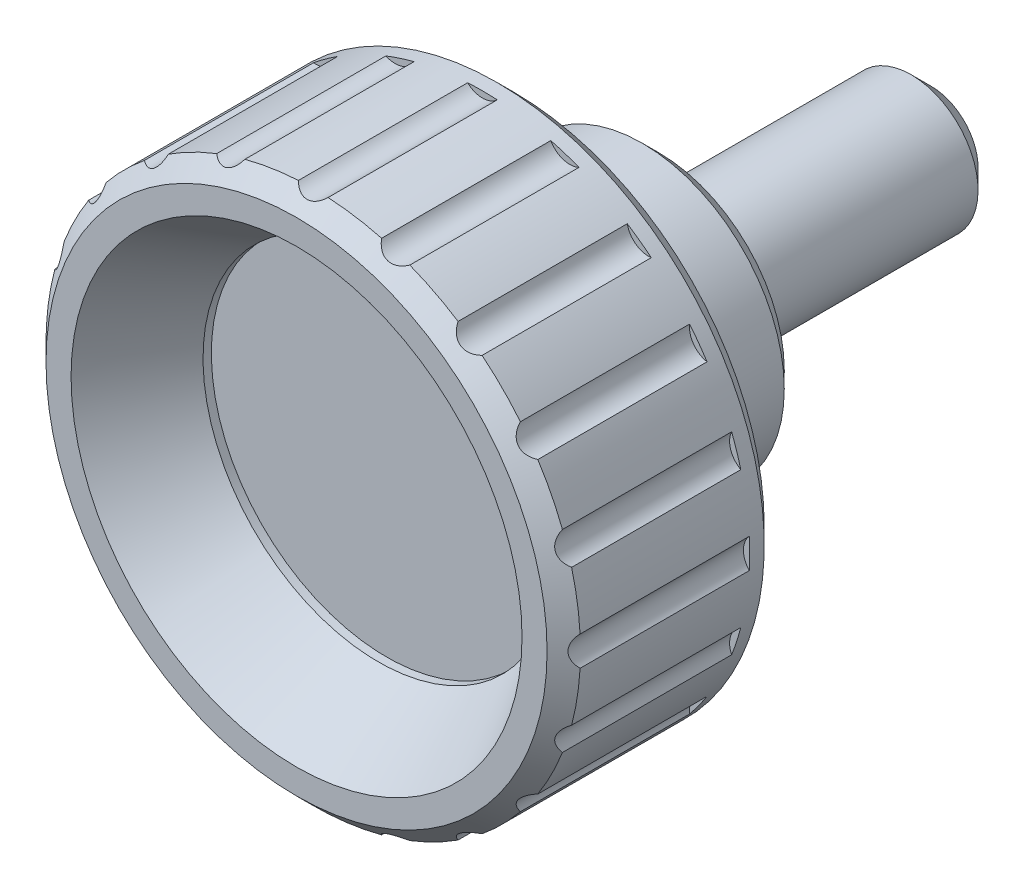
ISO-10303-21;
HEADER;
FILE_DESCRIPTION(('STEP AP214'),'2;1');
FILE_NAME('part.step','',(''),(''),'','','');
FILE_SCHEMA(('AUTOMOTIVE_DESIGN { 1 0 10303 214 1 1 1 1 }'));
ENDSEC;
DATA;
#1=APPLICATION_CONTEXT('core data for automotive mechanical design processes');
#2=APPLICATION_PROTOCOL_DEFINITION('international standard','automotive_design',2000,#1);
#3=PRODUCT_CONTEXT('',#1,'mechanical');
#4=PRODUCT('Part','Part','',(#3));
#5=PRODUCT_RELATED_PRODUCT_CATEGORY('part','',(#4));
#6=PRODUCT_DEFINITION_FORMATION('','',#4);
#7=PRODUCT_DEFINITION_CONTEXT('part definition',#1,'design');
#8=PRODUCT_DEFINITION('design','',#6,#7);
#9=PRODUCT_DEFINITION_SHAPE('','',#8);
#10=(LENGTH_UNIT() NAMED_UNIT(*) SI_UNIT(.MILLI.,.METRE.));
#11=(NAMED_UNIT(*) PLANE_ANGLE_UNIT() SI_UNIT($,.RADIAN.));
#12=(NAMED_UNIT(*) SI_UNIT($,.STERADIAN.) SOLID_ANGLE_UNIT());
#13=UNCERTAINTY_MEASURE_WITH_UNIT(LENGTH_MEASURE(1.E-05),#10,'distance_accuracy_value','');
#14=(GEOMETRIC_REPRESENTATION_CONTEXT(3) GLOBAL_UNCERTAINTY_ASSIGNED_CONTEXT((#13)) GLOBAL_UNIT_ASSIGNED_CONTEXT((#10,
#11,#12)) REPRESENTATION_CONTEXT('',''));
#15=CARTESIAN_POINT('',(0.,0.,0.));
#16=DIRECTION('',(0.,0.,1.));
#17=DIRECTION('',(1.,0.,0.));
#18=AXIS2_PLACEMENT_3D('',#15,#16,#17);
#19=CARTESIAN_POINT('',(0.,0.,0.));
#20=DIRECTION('',(0.,-3.55335756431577E-13,-1.));
#21=DIRECTION('',(0.,1.,-3.55335756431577E-13));
#22=AXIS2_PLACEMENT_3D('',#19,#20,#21);
#23=PLANE('',#22);
#24=CARTESIAN_POINT('',(0.,0.,0.));
#25=DIRECTION('',(0.,-3.55335756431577E-13,-1.));
#26=DIRECTION('',(0.,1.,-3.55335756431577E-13));
#27=AXIS2_PLACEMENT_3D('',#24,#25,#26);
#28=CIRCLE('',#27,5.);
#29=CARTESIAN_POINT('',(0.,5.,-1.77667878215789E-12));
#30=VERTEX_POINT('',#29);
#31=EDGE_CURVE('E1102',#30,#30,#28,.T.);
#32=ORIENTED_EDGE('',*,*,#31,.T.);
#33=EDGE_LOOP('',(#32));
#34=FACE_BOUND('',#33,.T.);
#35=CARTESIAN_POINT('',(0.,0.,0.));
#36=DIRECTION('',(0.,-3.55335756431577E-13,-1.));
#37=DIRECTION('',(0.,1.,-3.55335756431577E-13));
#38=AXIS2_PLACEMENT_3D('',#35,#36,#37);
#39=CIRCLE('',#38,4.);
#40=CARTESIAN_POINT('',(0.,4.,-1.42134302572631E-12));
#41=VERTEX_POINT('',#40);
#42=EDGE_CURVE('E1100',#41,#41,#39,.T.);
#43=ORIENTED_EDGE('',*,*,#42,.F.);
#44=EDGE_LOOP('',(#43));
#45=FACE_BOUND('',#44,.T.);
#46=ADVANCED_FACE('F14',(#34,#45),#23,.T.);
#47=CARTESIAN_POINT('',(-1.43127530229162E-12,7.46205088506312E-12,21.));
#48=DIRECTION('',(0.,-3.55335756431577E-13,-1.));
#49=DIRECTION('',(0.,1.,-3.55335756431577E-13));
#50=AXIS2_PLACEMENT_3D('',#47,#48,#49);
#51=CONICAL_SURFACE('',#50,16.,0.785398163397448);
#52=CARTESIAN_POINT('',(-1.49943126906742E-12,7.81738664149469E-12,22.));
#53=DIRECTION('',(0.,-3.55335756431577E-13,-1.));
#54=DIRECTION('',(0.,1.,-3.55335756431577E-13));
#55=AXIS2_PLACEMENT_3D('',#52,#53,#54);
#56=CIRCLE('',#55,15.);
#57=CARTESIAN_POINT('',(-1.49943126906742E-12,15.0000000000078,21.9999999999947));
#58=VERTEX_POINT('',#57);
#59=EDGE_CURVE('E582',#58,#58,#56,.T.);
#60=ORIENTED_EDGE('',*,*,#59,.T.);
#61=EDGE_LOOP('',(#60));
#62=FACE_BOUND('',#61,.T.);
#63=CARTESIAN_POINT('',(-1.43127530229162E-12,7.46205088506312E-12,21.));
#64=DIRECTION('',(0.,-3.55335756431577E-13,-1.));
#65=DIRECTION('',(0.,1.,-3.55335756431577E-13));
#66=AXIS2_PLACEMENT_3D('',#63,#64,#65);
#67=CIRCLE('',#66,16.);
#68=CARTESIAN_POINT('',(15.9753508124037,-0.887787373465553,21.0000000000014));
#69=VERTEX_POINT('',#68);
#70=CARTESIAN_POINT('',(15.4678028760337,-4.09231892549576,21.0000000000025));
#71=VERTEX_POINT('',#70);
#72=EDGE_CURVE('E587',#69,#71,#67,.T.);
#73=ORIENTED_EDGE('',*,*,#72,.F.);
#74=CARTESIAN_POINT('',(15.9755398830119,-0.887989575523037,20.9998000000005));
#75=CARTESIAN_POINT('',(15.9351784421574,-0.844826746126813,21.0424866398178));
#76=CARTESIAN_POINT('',(15.8966188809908,-0.797693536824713,21.0834537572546));
#77=CARTESIAN_POINT('',(15.8245769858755,-0.695019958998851,21.1602482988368));
#78=CARTESIAN_POINT('',(15.791150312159,-0.639398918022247,21.1960191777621));
#79=CARTESIAN_POINT('',(15.7380490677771,-0.532816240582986,21.2530008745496));
#80=CARTESIAN_POINT('',(15.7169614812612,-0.48337112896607,21.275690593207));
#81=CARTESIAN_POINT('',(15.6806455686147,-0.380207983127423,21.3148283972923));
#82=CARTESIAN_POINT('',(15.6653967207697,-0.326505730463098,21.3312983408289));
#83=CARTESIAN_POINT('',(15.6416857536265,-0.215315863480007,21.3569309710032));
#84=CARTESIAN_POINT('',(15.6332906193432,-0.157796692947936,21.366021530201));
#85=CARTESIAN_POINT('',(15.6243518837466,-0.0414082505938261,21.3757012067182));
#86=CARTESIAN_POINT('',(15.623808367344,0.0174610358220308,21.3762902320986));
#87=CARTESIAN_POINT('',(15.6301546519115,0.12624587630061,21.3694172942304));
#88=CARTESIAN_POINT('',(15.6360489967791,0.176295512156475,21.3630334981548));
#89=CARTESIAN_POINT('',(15.6532896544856,0.274274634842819,21.344383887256));
#90=CARTESIAN_POINT('',(15.6646343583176,0.322204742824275,21.33211980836));
#91=CARTESIAN_POINT('',(15.6925197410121,0.416525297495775,21.3020256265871));
#92=CARTESIAN_POINT('',(15.709218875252,0.462813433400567,21.2840259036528));
#93=CARTESIAN_POINT('',(15.7468524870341,0.551635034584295,21.2435491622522));
#94=CARTESIAN_POINT('',(15.7677958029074,0.594160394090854,21.2210628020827));
#95=CARTESIAN_POINT('',(15.8173070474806,0.682678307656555,21.168037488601));
#96=CARTESIAN_POINT('',(15.846568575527,0.727842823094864,21.1367787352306));
#97=CARTESIAN_POINT('',(15.9086393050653,0.812237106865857,21.0706895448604));
#98=CARTESIAN_POINT('',(15.9414255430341,0.851501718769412,21.0358822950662));
#99=CARTESIAN_POINT('',(15.9755398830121,0.887989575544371,20.9998));
#100=B_SPLINE_CURVE_WITH_KNOTS('',3,(#74,#75,#76,#77,#78,#79,#80,#81,#82,#83,#84,#85,#86,#87,
#88,#89,#90,#91,#92,#93,#94,#95,#96,#97,#98,#99),.UNSPECIFIED.,.F.,.F.,(4,2,2,2,2,2,2,2,2,2,2,2,
4),(0.,0.219100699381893,0.440431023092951,0.61478688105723,0.7885241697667,0.96393981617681,
1.13935735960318,1.29104866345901,1.44269521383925,1.59932369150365,1.75628175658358,
1.94245598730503,2.12748340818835),.UNSPECIFIED.);
#101=CARTESIAN_POINT('',(15.9753508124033,0.887787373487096,21.0000000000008));
#102=VERTEX_POINT('',#101);
#103=EDGE_CURVE('E588',#69,#102,#100,.T.);
#104=ORIENTED_EDGE('',*,*,#103,.T.);
#105=CARTESIAN_POINT('',(15.467802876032,4.09231892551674,20.9999999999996));
#106=VERTEX_POINT('',#105);
#107=EDGE_CURVE('E591',#106,#102,#67,.T.);
#108=ORIENTED_EDGE('',*,*,#107,.F.);
#109=CARTESIAN_POINT('',(15.4680028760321,4.09220841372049,20.9998349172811));
#110=CARTESIAN_POINT('',(15.4162815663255,4.12078731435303,21.0425185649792));
#111=CARTESIAN_POINT('',(15.3650471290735,4.15369881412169,21.0834826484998));
#112=CARTESIAN_POINT('',(15.2648091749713,4.22908574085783,21.1602711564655));
#113=CARTESIAN_POINT('',(15.2158336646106,4.27165508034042,21.1960390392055));
#114=CARTESIAN_POINT('',(15.1323998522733,4.35661227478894,21.2530163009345));
#115=CARTESIAN_POINT('',(15.0970664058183,4.39712151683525,21.2757043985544));
#116=CARTESIAN_POINT('',(15.030651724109,4.48401408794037,21.3148389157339));
#117=CARTESIAN_POINT('',(14.9995558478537,4.530376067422,21.3313071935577));
#118=CARTESIAN_POINT('',(14.9426490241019,4.62879687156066,21.3569365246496));
#119=CARTESIAN_POINT('',(14.9168920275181,4.68090639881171,21.3660254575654));
#120=CARTESIAN_POINT('',(14.8724279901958,4.78883525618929,21.3757021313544));
#121=CARTESIAN_POINT('',(14.8537210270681,4.84465462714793,21.3762897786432));
#122=CARTESIAN_POINT('',(14.8261428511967,4.95007522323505,21.3694146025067));
#123=CARTESIAN_POINT('',(14.8162835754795,4.9994964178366,21.363029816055));
#124=CARTESIAN_POINT('',(14.8024051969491,5.09800697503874,21.3443784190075));
#125=CARTESIAN_POINT('',(14.7983843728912,5.14709643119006,21.3321135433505));
#126=CARTESIAN_POINT('',(14.7957600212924,5.2454174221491,21.302017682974));
#127=CARTESIAN_POINT('',(14.7973389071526,5.29460058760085,21.2840169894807));
#128=CARTESIAN_POINT('',(14.8056849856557,5.39070462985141,21.243538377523));
#129=CARTESIAN_POINT('',(14.8124630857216,5.43762052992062,21.2210511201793));
#130=CARTESIAN_POINT('',(14.8321965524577,5.53709129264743,21.1680316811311));
#131=CARTESIAN_POINT('',(14.8460657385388,5.58907402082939,21.1367810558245));
#132=CARTESIAN_POINT('',(14.8790094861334,5.6884938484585,21.0707098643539));
#133=CARTESIAN_POINT('',(14.8980514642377,5.73595697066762,21.0359124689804));
#134=CARTESIAN_POINT('',(14.9192136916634,5.78119085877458,20.9998404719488));
#135=B_SPLINE_CURVE_WITH_KNOTS('',3,(#109,#110,#111,#112,#113,#114,#115,#116,#117,#118,#119,
#120,#121,#122,#123,#124,#125,#126,#127,#128,#129,#130,#131,#132,#133,#134),.UNSPECIFIED.,.F.,
.F.,(4,2,2,2,2,2,2,2,2,2,2,2,4),(0.,0.219090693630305,0.440410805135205,0.614763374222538,
0.788497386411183,0.963909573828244,1.13932369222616,1.29101393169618,1.44265944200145,
1.59928961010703,1.75624927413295,1.94237523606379,2.12735493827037),.UNSPECIFIED.);
#136=CARTESIAN_POINT('',(14.9191201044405,5.78099085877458,20.9999999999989));
#137=VERTEX_POINT('',#136);
#138=EDGE_CURVE('E276',#106,#137,#135,.T.);
#139=ORIENTED_EDGE('',*,*,#138,.T.);
#140=CARTESIAN_POINT('',(13.4461586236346,8.67184053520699,20.9999999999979));
#141=VERTEX_POINT('',#140);
#142=EDGE_CURVE('E594',#141,#137,#67,.T.);
#143=ORIENTED_EDGE('',*,*,#142,.F.);
#144=CARTESIAN_POINT('',(13.4463586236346,8.6718019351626,20.9998528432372));
#145=CARTESIAN_POINT('',(13.3883385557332,8.68300023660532,21.0425349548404));
#146=CARTESIAN_POINT('',(13.329442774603,8.69846942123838,21.0834974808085));
#147=CARTESIAN_POINT('',(13.2108177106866,8.73919269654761,21.1602828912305));
#148=CARTESIAN_POINT('',(13.151086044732,8.76454475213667,21.1960492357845));
#149=CARTESIAN_POINT('',(13.045484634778,8.81956217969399,21.2530242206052));
#150=CARTESIAN_POINT('',(12.9993630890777,8.84717062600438,21.275711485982));
#151=CARTESIAN_POINT('',(12.9093490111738,8.90928797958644,21.3148443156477));
#152=CARTESIAN_POINT('',(12.865449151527,8.94377205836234,21.3313117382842));
#153=CARTESIAN_POINT('',(12.7809154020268,9.0197911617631,21.3569393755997));
#154=CARTESIAN_POINT('',(12.7403171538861,9.06139107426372,21.3660274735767));
#155=CARTESIAN_POINT('',(12.6646792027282,9.15029744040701,21.3757026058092));
#156=CARTESIAN_POINT('',(12.6296395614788,9.19760395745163,21.3762895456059));
#157=CARTESIAN_POINT('',(12.5708357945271,9.28934266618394,21.3694132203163));
#158=CARTESIAN_POINT('',(12.5461876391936,9.33329835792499,21.3630279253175));
#159=CARTESIAN_POINT('',(12.5025481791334,9.42269874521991,21.3443756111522));
#160=CARTESIAN_POINT('',(12.4835552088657,9.46814299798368,21.3321103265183));
#161=CARTESIAN_POINT('',(12.4506773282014,9.56084100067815,21.3020136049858));
#162=CARTESIAN_POINT('',(12.4369809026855,9.6081051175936,21.2840124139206));
#163=CARTESIAN_POINT('',(12.4152215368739,9.70208497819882,21.2435328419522));
#164=CARTESIAN_POINT('',(12.4071705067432,9.7487993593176,21.2210451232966));
#165=CARTESIAN_POINT('',(12.3952016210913,9.84949409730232,21.168027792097));
#166=CARTESIAN_POINT('',(12.3923288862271,9.9032128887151,21.1367802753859));
#167=CARTESIAN_POINT('',(12.3929374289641,10.0079364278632,21.0707160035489));
#168=CARTESIAN_POINT('',(12.3963796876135,10.0589558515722,21.0359224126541));
#169=CARTESIAN_POINT('',(12.4025267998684,10.1085106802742,20.9998544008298));
#170=B_SPLINE_CURVE_WITH_KNOTS('',3,(#144,#145,#146,#147,#148,#149,#150,#151,#152,#153,#154,
#155,#156,#157,#158,#159,#160,#161,#162,#163,#164,#165,#166,#167,#168,#169),.UNSPECIFIED.,.F.,
.F.,(4,2,2,2,2,2,2,2,2,2,2,2,4),(0.,0.21908555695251,0.440400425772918,0.61475130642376,
0.788483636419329,0.963894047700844,1.1393064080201,1.29099610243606,1.4426410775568,
1.59927210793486,1.75623259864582,1.94233964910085,2.12730065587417),.UNSPECIFIED.);
#171=CARTESIAN_POINT('',(12.4025019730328,10.1083106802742,20.9999999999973));
#172=VERTEX_POINT('',#171);
#173=EDGE_CURVE('E517',#141,#172,#170,.T.);
#174=ORIENTED_EDGE('',*,*,#173,.T.);
#175=CARTESIAN_POINT('',(10.1083106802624,12.4025019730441,20.9999999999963));
#176=VERTEX_POINT('',#175);
#177=EDGE_CURVE('E1303',#176,#172,#67,.T.);
#178=ORIENTED_EDGE('',*,*,#177,.F.);
#179=CARTESIAN_POINT('',(10.1085106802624,12.4025267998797,20.9998544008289));
#180=CARTESIAN_POINT('',(10.0498699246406,12.3952479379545,21.042536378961));
#181=CARTESIAN_POINT('',(9.9890765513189,12.3917603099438,21.0834987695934));
#182=CARTESIAN_POINT('',(9.86367341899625,12.3938334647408,21.1602839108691));
#183=CARTESIAN_POINT('',(9.79903112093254,12.3994866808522,21.1960501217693));
#184=CARTESIAN_POINT('',(9.68159704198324,12.4191788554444,21.2530249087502));
#185=CARTESIAN_POINT('',(9.62920140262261,12.4311837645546,21.2757121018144));
#186=CARTESIAN_POINT('',(9.52439769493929,12.4624451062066,21.3148447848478));
#187=CARTESIAN_POINT('',(9.47199033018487,12.4816756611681,21.3313121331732));
#188=CARTESIAN_POINT('',(9.36810287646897,12.527851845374,21.3569396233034));
#189=CARTESIAN_POINT('',(9.31663663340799,12.5548702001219,21.3660276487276));
#190=CARTESIAN_POINT('',(9.21722722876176,12.6160518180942,21.3757026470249));
#191=CARTESIAN_POINT('',(9.16928410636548,12.6502151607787,21.3762895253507));
#192=CARTESIAN_POINT('',(9.08500969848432,12.7192925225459,21.3694131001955));
#193=CARTESIAN_POINT('',(9.04798489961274,12.7534801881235,21.3630277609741));
#194=CARTESIAN_POINT('',(8.97885516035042,12.825019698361,21.3443753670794));
#195=CARTESIAN_POINT('',(8.94674877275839,12.8623706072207,21.3321100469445));
#196=CARTESIAN_POINT('',(8.8868348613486,12.9403718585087,21.3020132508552));
#197=CARTESIAN_POINT('',(8.85920339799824,12.9810903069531,21.2840120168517));
#198=CARTESIAN_POINT('',(8.80946769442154,13.0637465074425,21.243532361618));
#199=CARTESIAN_POINT('',(8.78737520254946,13.1056866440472,21.2210446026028));
#200=CARTESIAN_POINT('',(8.74487571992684,13.1977546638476,21.1680270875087));
#201=CARTESIAN_POINT('',(8.72554355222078,13.247956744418,21.1367794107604));
#202=CARTESIAN_POINT('',(8.69376097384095,13.3477431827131,21.0707148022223));
#203=CARTESIAN_POINT('',(8.68126891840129,13.3973294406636,21.0359210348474));
#204=CARTESIAN_POINT('',(8.67180193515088,13.4463586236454,20.9998528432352));
#205=B_SPLINE_CURVE_WITH_KNOTS('',3,(#179,#180,#181,#182,#183,#184,#185,#186,#187,#188,#189,
#190,#191,#192,#193,#194,#195,#196,#197,#198,#199,#200,#201,#202,#203,#204),.UNSPECIFIED.,.F.,
.F.,(4,2,2,2,2,2,2,2,2,2,2,2,4),(0.,0.219085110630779,0.440399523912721,0.614750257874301,
0.788482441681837,0.963892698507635,1.13930490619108,1.29099455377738,1.44263948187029,
1.599270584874,1.75623114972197,1.94233892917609,2.12730065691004),.UNSPECIFIED.);
#206=CARTESIAN_POINT('',(8.67184053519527,13.4461586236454,20.9999999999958));
#207=VERTEX_POINT('',#206);
#208=EDGE_CURVE('E1293',#176,#207,#205,.T.);
#209=ORIENTED_EDGE('',*,*,#208,.T.);
#210=CARTESIAN_POINT('',(5.78099085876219,14.9191201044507,20.9999999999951));
#211=VERTEX_POINT('',#210);
#212=EDGE_CURVE('E601',#211,#207,#67,.T.);
#213=ORIENTED_EDGE('',*,*,#212,.F.);
#214=CARTESIAN_POINT('',(5.78119085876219,14.9192136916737,20.9998404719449));
#215=CARTESIAN_POINT('',(5.72766915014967,14.8941689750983,21.0425236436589));
#216=CARTESIAN_POINT('',(5.67092851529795,14.872064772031,21.0834872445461));
#217=CARTESIAN_POINT('',(5.5510212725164,14.8352827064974,21.1602747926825));
#218=CARTESIAN_POINT('',(5.48779515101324,14.8206827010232,21.1960421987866));
#219=CARTESIAN_POINT('',(5.37002254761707,14.8031204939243,21.2530187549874));
#220=CARTESIAN_POINT('',(5.31648146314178,14.7983461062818,21.2757065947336));
#221=CARTESIAN_POINT('',(5.20714649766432,14.7956901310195,21.3148405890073));
#222=CARTESIAN_POINT('',(5.15136128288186,14.7977841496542,21.3313086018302));
#223=CARTESIAN_POINT('',(5.03828848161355,14.8095962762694,21.3569374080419));
#224=CARTESIAN_POINT('',(4.98099158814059,14.8193878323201,21.3660260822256));
#225=CARTESIAN_POINT('',(4.86754042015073,14.8468549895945,21.3757022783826));
#226=CARTESIAN_POINT('',(4.81138615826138,14.8645306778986,21.3762897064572));
#227=CARTESIAN_POINT('',(4.7098894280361,14.9041843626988,21.3694141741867));
#228=CARTESIAN_POINT('',(4.66411184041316,14.9252571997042,21.3630292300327));
#229=CARTESIAN_POINT('',(4.5762579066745,14.971932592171,21.344377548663));
#230=CARTESIAN_POINT('',(4.53418047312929,14.9975338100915,21.3321125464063));
#231=CARTESIAN_POINT('',(4.45309476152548,15.0532024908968,21.3020164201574));
#232=CARTESIAN_POINT('',(4.41423284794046,15.0833891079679,21.2840155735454));
#233=CARTESIAN_POINT('',(4.3413888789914,15.1466300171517,21.2435366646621));
#234=CARTESIAN_POINT('',(4.30741726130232,15.1796902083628,21.2210492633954));
#235=CARTESIAN_POINT('',(4.2385424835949,15.2541231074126,21.1680291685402));
#236=CARTESIAN_POINT('',(4.20463940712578,15.2958988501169,21.136777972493));
#237=CARTESIAN_POINT('',(4.1435705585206,15.3809897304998,21.0707055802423));
#238=CARTESIAN_POINT('',(4.11636458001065,15.4242938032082,21.0359075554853));
#239=CARTESIAN_POINT('',(4.09220841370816,15.4680028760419,20.9998349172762));
#240=B_SPLINE_CURVE_WITH_KNOTS('',3,(#214,#215,#216,#217,#218,#219,#220,#221,#222,#223,#224,
#225,#226,#227,#228,#229,#230,#231,#232,#233,#234,#235,#236,#237,#238,#239),.UNSPECIFIED.,.F.,
.F.,(4,2,2,2,2,2,2,2,2,2,2,2,4),(0.,0.21908910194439,0.440407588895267,0.614759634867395,
0.78849312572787,0.963904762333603,1.13931833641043,1.29100840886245,1.44265375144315,
1.59928417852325,1.7562441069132,1.9423726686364,2.12735494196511),.UNSPECIFIED.);
#241=CARTESIAN_POINT('',(4.09231892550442,15.4678028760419,20.9999999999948));
#242=VERTEX_POINT('',#241);
#243=EDGE_CURVE('E1285',#211,#242,#240,.T.);
#244=ORIENTED_EDGE('',*,*,#243,.T.);
#245=CARTESIAN_POINT('',(0.887787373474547,15.9753508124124,20.9999999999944));
#246=VERTEX_POINT('',#245);
#247=EDGE_CURVE('E597',#246,#242,#67,.T.);
#248=ORIENTED_EDGE('',*,*,#247,.F.);
#249=CARTESIAN_POINT('',(0.887987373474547,15.9755378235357,20.9998021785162));
#250=CARTESIAN_POINT('',(0.844824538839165,15.9351765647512,21.0424886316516));
#251=CARTESIAN_POINT('',(0.797691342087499,15.8966171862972,21.0834555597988));
#252=CARTESIAN_POINT('',(0.695017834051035,15.8245756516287,21.1602497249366));
#253=CARTESIAN_POINT('',(0.639396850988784,15.7911491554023,21.1960204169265));
#254=CARTESIAN_POINT('',(0.532814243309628,15.7380481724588,21.2530018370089));
#255=CARTESIAN_POINT('',(0.483369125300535,15.716960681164,21.2756914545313));
#256=CARTESIAN_POINT('',(0.380205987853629,15.6806449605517,21.3148290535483));
#257=CARTESIAN_POINT('',(0.326503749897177,15.665396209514,21.3312988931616));
#258=CARTESIAN_POINT('',(0.215313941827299,15.6416854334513,21.3569313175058));
#259=CARTESIAN_POINT('',(0.157794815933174,15.6332903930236,21.3660217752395));
#260=CARTESIAN_POINT('',(0.0414064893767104,15.6243518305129,21.3757012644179));
#261=CARTESIAN_POINT('',(-0.0174627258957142,15.6238083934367,21.3762902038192));
#262=CARTESIAN_POINT('',(-0.1262474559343,15.6301548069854,21.3694171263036));
#263=CARTESIAN_POINT('',(-0.176297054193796,15.6360492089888,21.3630332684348));
#264=CARTESIAN_POINT('',(-0.274276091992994,15.6532899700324,21.3443835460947));
#265=CARTESIAN_POINT('',(-0.322206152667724,15.664634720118,21.332119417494));
#266=CARTESIAN_POINT('',(-0.416526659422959,15.6925202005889,21.3020251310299));
#267=CARTESIAN_POINT('',(-0.462814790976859,15.7092193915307,21.2840253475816));
#268=CARTESIAN_POINT('',(-0.551636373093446,15.7468531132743,21.2435484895));
#269=CARTESIAN_POINT('',(-0.594161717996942,15.7677964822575,21.2210620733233));
#270=CARTESIAN_POINT('',(-0.682678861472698,15.8173074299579,21.1680370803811));
#271=CARTESIAN_POINT('',(-0.72784270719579,15.8465685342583,21.1367787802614));
#272=CARTESIAN_POINT('',(-0.812235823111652,15.9086383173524,21.0706905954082));
#273=CARTESIAN_POINT('',(-0.851499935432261,15.9414240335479,21.0358838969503));
#274=CARTESIAN_POINT('',(-0.887987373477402,15.9755378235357,20.999802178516));
#275=B_SPLINE_CURVE_WITH_KNOTS('',3,(#249,#250,#251,#252,#253,#254,#255,#256,#257,#258,#259,
#260,#261,#262,#263,#264,#265,#266,#267,#268,#269,#270,#271,#272,#273,#274),.UNSPECIFIED.,.F.,
.F.,(4,2,2,2,2,2,2,2,2,2,2,2,4),(0.,0.219100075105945,0.440429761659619,0.614785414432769,
0.788522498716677,0.963937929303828,1.13935525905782,1.29104649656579,1.44269298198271,
1.59932156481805,1.75627972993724,1.94245124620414,2.12747598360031),.UNSPECIFIED.);
#276=CARTESIAN_POINT('',(-0.887787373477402,15.9753508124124,20.9999999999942));
#277=VERTEX_POINT('',#276);
#278=EDGE_CURVE('E1278',#246,#277,#275,.T.);
#279=ORIENTED_EDGE('',*,*,#278,.T.);
#280=CARTESIAN_POINT('',(-4.09231892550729,15.4678028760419,20.9999999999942));
#281=VERTEX_POINT('',#280);
#282=EDGE_CURVE('E602',#281,#277,#67,.T.);
#283=ORIENTED_EDGE('',*,*,#282,.F.);
#284=CARTESIAN_POINT('',(-4.09220841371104,15.4680028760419,20.9998349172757));
#285=CARTESIAN_POINT('',(-4.12078731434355,15.4162815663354,21.0425185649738));
#286=CARTESIAN_POINT('',(-4.15369881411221,15.3650471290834,21.0834826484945));
#287=CARTESIAN_POINT('',(-4.22908574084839,15.2648091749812,21.1602711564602));
#288=CARTESIAN_POINT('',(-4.271655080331,15.2158336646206,21.1960390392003));
#289=CARTESIAN_POINT('',(-4.35661227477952,15.1323998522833,21.2530163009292));
#290=CARTESIAN_POINT('',(-4.39712151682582,15.0970664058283,21.2757043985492));
#291=CARTESIAN_POINT('',(-4.48401408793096,15.0306517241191,21.3148389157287));
#292=CARTESIAN_POINT('',(-4.53037606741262,14.9995558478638,21.3313071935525));
#293=CARTESIAN_POINT('',(-4.6287968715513,14.942649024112,21.3569365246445));
#294=CARTESIAN_POINT('',(-4.68090639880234,14.9168920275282,21.3660254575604));
#295=CARTESIAN_POINT('',(-4.78883525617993,14.872427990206,21.3757021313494));
#296=CARTESIAN_POINT('',(-4.84465462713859,14.8537210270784,21.3762897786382));
#297=CARTESIAN_POINT('',(-4.95007522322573,14.826142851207,21.3694146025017));
#298=CARTESIAN_POINT('',(-4.99949641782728,14.8162835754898,21.3630298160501));
#299=CARTESIAN_POINT('',(-5.09800697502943,14.8024051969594,21.3443784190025));
#300=CARTESIAN_POINT('',(-5.14709643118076,14.7983843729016,21.3321135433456));
#301=CARTESIAN_POINT('',(-5.24541742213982,14.7957600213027,21.3020176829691));
#302=CARTESIAN_POINT('',(-5.29460058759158,14.797338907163,21.2840169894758));
#303=CARTESIAN_POINT('',(-5.39070462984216,14.805684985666,21.2435383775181));
#304=CARTESIAN_POINT('',(-5.43762052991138,14.8124630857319,21.2210511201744));
#305=CARTESIAN_POINT('',(-5.53709129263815,14.832196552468,21.1680316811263));
#306=CARTESIAN_POINT('',(-5.58907402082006,14.8460657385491,21.1367810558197));
#307=CARTESIAN_POINT('',(-5.68849384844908,14.8790094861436,21.0707098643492));
#308=CARTESIAN_POINT('',(-5.73595697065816,14.8980514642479,21.0359124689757));
#309=CARTESIAN_POINT('',(-5.78119085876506,14.9192136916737,20.9998404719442));
#310=B_SPLINE_CURVE_WITH_KNOTS('',3,(#284,#285,#286,#287,#288,#289,#290,#291,#292,#293,#294,
#295,#296,#297,#298,#299,#300,#301,#302,#303,#304,#305,#306,#307,#308,#309),.UNSPECIFIED.,.F.,
.F.,(4,2,2,2,2,2,2,2,2,2,2,2,4),(0.,0.219090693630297,0.440410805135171,0.614763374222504,
0.788497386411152,0.96390957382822,1.13932369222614,1.29101393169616,1.44265944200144,
1.59928961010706,1.75624927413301,1.94237523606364,2.12735493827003),.UNSPECIFIED.);
#311=CARTESIAN_POINT('',(-5.78099085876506,14.9191201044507,20.9999999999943));
#312=VERTEX_POINT('',#311);
#313=EDGE_CURVE('E1271',#281,#312,#310,.T.);
#314=ORIENTED_EDGE('',*,*,#313,.T.);
#315=CARTESIAN_POINT('',(-8.67184053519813,13.4461586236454,20.9999999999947));
#316=VERTEX_POINT('',#315);
#317=EDGE_CURVE('E1140',#316,#312,#67,.T.);
#318=ORIENTED_EDGE('',*,*,#317,.F.);
#319=CARTESIAN_POINT('',(-8.67180193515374,13.4463586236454,20.999852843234));
#320=CARTESIAN_POINT('',(-8.68300023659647,13.3883385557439,21.0425349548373));
#321=CARTESIAN_POINT('',(-8.69846942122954,13.3294427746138,21.0834974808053));
#322=CARTESIAN_POINT('',(-8.73919269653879,13.2108177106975,21.1602828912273));
#323=CARTESIAN_POINT('',(-8.76454475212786,13.1510860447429,21.1960492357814));
#324=CARTESIAN_POINT('',(-8.81956217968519,13.0454846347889,21.253024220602));
#325=CARTESIAN_POINT('',(-8.84717062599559,12.9993630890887,21.2757114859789));
#326=CARTESIAN_POINT('',(-8.90928797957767,12.9093490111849,21.3148443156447));
#327=CARTESIAN_POINT('',(-8.94377205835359,12.8654491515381,21.3313117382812));
#328=CARTESIAN_POINT('',(-9.01979116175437,12.780915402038,21.3569393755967));
#329=CARTESIAN_POINT('',(-9.06139107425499,12.7403171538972,21.3660274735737));
#330=CARTESIAN_POINT('',(-9.1502974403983,12.6646792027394,21.3757026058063));
#331=CARTESIAN_POINT('',(-9.19760395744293,12.62963956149,21.376289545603));
#332=CARTESIAN_POINT('',(-9.28934266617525,12.5708357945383,21.3694132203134));
#333=CARTESIAN_POINT('',(-9.3332983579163,12.5461876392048,21.3630279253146));
#334=CARTESIAN_POINT('',(-9.42269874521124,12.5025481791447,21.3443756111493));
#335=CARTESIAN_POINT('',(-9.46814299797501,12.483555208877,21.3321103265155));
#336=CARTESIAN_POINT('',(-9.56084100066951,12.4506773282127,21.302013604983));
#337=CARTESIAN_POINT('',(-9.60810511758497,12.4369809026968,21.2840124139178));
#338=CARTESIAN_POINT('',(-9.70208497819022,12.4152215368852,21.2435328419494));
#339=CARTESIAN_POINT('',(-9.74879935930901,12.4071705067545,21.2210451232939));
#340=CARTESIAN_POINT('',(-9.84949409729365,12.3952016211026,21.1680277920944));
#341=CARTESIAN_POINT('',(-9.90321288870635,12.3923288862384,21.1367802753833));
#342=CARTESIAN_POINT('',(-10.0079364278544,12.3929374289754,21.0707160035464));
#343=CARTESIAN_POINT('',(-10.0589558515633,12.3963796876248,21.0359224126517));
#344=CARTESIAN_POINT('',(-10.1085106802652,12.4025267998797,20.9998544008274));
#345=B_SPLINE_CURVE_WITH_KNOTS('',3,(#319,#320,#321,#322,#323,#324,#325,#326,#327,#328,#329,
#330,#331,#332,#333,#334,#335,#336,#337,#338,#339,#340,#341,#342,#343,#344),.UNSPECIFIED.,.F.,
.F.,(4,2,2,2,2,2,2,2,2,2,2,2,4),(0.,0.21908555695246,0.440400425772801,0.614751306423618,
0.78848363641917,0.96389404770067,1.13930640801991,1.29099610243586,1.4426410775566,
1.59927210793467,1.75623259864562,1.94233964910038,2.12730065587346),.UNSPECIFIED.);
#346=CARTESIAN_POINT('',(-10.1083106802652,12.4025019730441,20.9999999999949));
#347=VERTEX_POINT('',#346);
#348=EDGE_CURVE('E1264',#316,#347,#345,.T.);
#349=ORIENTED_EDGE('',*,*,#348,.T.);
#350=CARTESIAN_POINT('',(-12.402501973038,10.1083106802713,20.9999999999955));
#351=VERTEX_POINT('',#350);
#352=EDGE_CURVE('E1143',#351,#347,#67,.T.);
#353=ORIENTED_EDGE('',*,*,#352,.F.);
#354=CARTESIAN_POINT('',(-12.4025267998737,10.1085106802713,20.9998544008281));
#355=CARTESIAN_POINT('',(-12.3952479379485,10.0498699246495,21.0425363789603));
#356=CARTESIAN_POINT('',(-12.3917603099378,9.98907655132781,21.0834987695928));
#357=CARTESIAN_POINT('',(-12.3938334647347,9.86367341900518,21.1602839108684));
#358=CARTESIAN_POINT('',(-12.3994866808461,9.79903112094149,21.1960501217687));
#359=CARTESIAN_POINT('',(-12.4191788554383,9.6815970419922,21.2530249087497));
#360=CARTESIAN_POINT('',(-12.4311837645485,9.62920140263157,21.2757121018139));
#361=CARTESIAN_POINT('',(-12.4624451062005,9.52439769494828,21.3148447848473));
#362=CARTESIAN_POINT('',(-12.481675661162,9.47199033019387,21.3313121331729));
#363=CARTESIAN_POINT('',(-12.5278518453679,9.36810287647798,21.356939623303));
#364=CARTESIAN_POINT('',(-12.5548702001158,9.316636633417,21.3660276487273));
#365=CARTESIAN_POINT('',(-12.6160518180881,9.21722722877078,21.3757026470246));
#366=CARTESIAN_POINT('',(-12.6502151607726,9.1692841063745,21.3762895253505));
#367=CARTESIAN_POINT('',(-12.7192925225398,9.08500969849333,21.3694131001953));
#368=CARTESIAN_POINT('',(-12.7534801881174,9.04798489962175,21.363027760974));
#369=CARTESIAN_POINT('',(-12.8250196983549,8.97885516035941,21.3443753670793));
#370=CARTESIAN_POINT('',(-12.8623706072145,8.94674877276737,21.3321100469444));
#371=CARTESIAN_POINT('',(-12.9403718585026,8.88683486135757,21.3020132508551));
#372=CARTESIAN_POINT('',(-12.9810903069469,8.8592033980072,21.2840120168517));
#373=CARTESIAN_POINT('',(-13.0637465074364,8.8094676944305,21.243532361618));
#374=CARTESIAN_POINT('',(-13.1056866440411,8.78737520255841,21.2210446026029));
#375=CARTESIAN_POINT('',(-13.1977546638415,8.74487571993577,21.1680270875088));
#376=CARTESIAN_POINT('',(-13.247956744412,8.72554355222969,21.1367794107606));
#377=CARTESIAN_POINT('',(-13.347743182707,8.69376097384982,21.0707148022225));
#378=CARTESIAN_POINT('',(-13.3973294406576,8.68126891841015,21.0359210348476));
#379=CARTESIAN_POINT('',(-13.4463586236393,8.67180193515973,20.9998528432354));
#380=B_SPLINE_CURVE_WITH_KNOTS('',3,(#354,#355,#356,#357,#358,#359,#360,#361,#362,#363,#364,
#365,#366,#367,#368,#369,#370,#371,#372,#373,#374,#375,#376,#377,#378,#379),.UNSPECIFIED.,.F.,
.F.,(4,2,2,2,2,2,2,2,2,2,2,2,4),(0.,0.219085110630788,0.440399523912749,0.614750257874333,
0.788482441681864,0.963892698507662,1.13930490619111,1.29099455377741,1.44263948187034,
1.59927058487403,1.75623114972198,1.94233892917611,2.12730065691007),.UNSPECIFIED.);
#381=CARTESIAN_POINT('',(-13.4461586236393,8.67184053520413,20.999999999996));
#382=VERTEX_POINT('',#381);
#383=EDGE_CURVE('E1254',#351,#382,#380,.T.);
#384=ORIENTED_EDGE('',*,*,#383,.T.);
#385=CARTESIAN_POINT('',(-14.9191201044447,5.78099085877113,20.999999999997));
#386=VERTEX_POINT('',#385);
#387=EDGE_CURVE('E1146',#386,#382,#67,.T.);
#388=ORIENTED_EDGE('',*,*,#387,.F.);
#389=CARTESIAN_POINT('',(-14.9192136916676,5.78119085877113,20.9998404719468));
#390=CARTESIAN_POINT('',(-14.8941689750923,5.7276691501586,21.0425236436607));
#391=CARTESIAN_POINT('',(-14.8720647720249,5.6709285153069,21.0834872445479));
#392=CARTESIAN_POINT('',(-14.8352827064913,5.5510212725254,21.1602747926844));
#393=CARTESIAN_POINT('',(-14.8206827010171,5.48779515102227,21.1960421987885));
#394=CARTESIAN_POINT('',(-14.8031204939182,5.37002254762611,21.2530187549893));
#395=CARTESIAN_POINT('',(-14.7983461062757,5.31648146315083,21.2757065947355));
#396=CARTESIAN_POINT('',(-14.7956901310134,5.20714649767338,21.3148405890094));
#397=CARTESIAN_POINT('',(-14.797784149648,5.15136128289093,21.3313086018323));
#398=CARTESIAN_POINT('',(-14.8095962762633,5.03828848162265,21.356937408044));
#399=CARTESIAN_POINT('',(-14.819387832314,4.9809915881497,21.3660260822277));
#400=CARTESIAN_POINT('',(-14.8468549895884,4.86754042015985,21.3757022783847));
#401=CARTESIAN_POINT('',(-14.8645306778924,4.81138615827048,21.3762897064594));
#402=CARTESIAN_POINT('',(-14.9041843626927,4.70988942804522,21.369414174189));
#403=CARTESIAN_POINT('',(-14.9252571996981,4.66411184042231,21.363029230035));
#404=CARTESIAN_POINT('',(-14.9719325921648,4.57625790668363,21.3443775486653));
#405=CARTESIAN_POINT('',(-14.9975338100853,4.53418047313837,21.3321125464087));
#406=CARTESIAN_POINT('',(-15.0532024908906,4.45309476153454,21.3020164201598));
#407=CARTESIAN_POINT('',(-15.0833891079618,4.41423284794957,21.2840155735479));
#408=CARTESIAN_POINT('',(-15.1466300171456,4.3413888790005,21.2435366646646));
#409=CARTESIAN_POINT('',(-15.1796902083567,4.30741726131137,21.2210492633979));
#410=CARTESIAN_POINT('',(-15.2541231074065,4.2385424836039,21.1680291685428));
#411=CARTESIAN_POINT('',(-15.2958988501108,4.20463940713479,21.1367779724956));
#412=CARTESIAN_POINT('',(-15.3809897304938,4.14357055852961,21.0707055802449));
#413=CARTESIAN_POINT('',(-15.4242938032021,4.11636458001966,21.0359075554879));
#414=CARTESIAN_POINT('',(-15.4680028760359,4.0922084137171,20.9998349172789));
#415=B_SPLINE_CURVE_WITH_KNOTS('',3,(#389,#390,#391,#392,#393,#394,#395,#396,#397,#398,#399,
#400,#401,#402,#403,#404,#405,#406,#407,#408,#409,#410,#411,#412,#413,#414),.UNSPECIFIED.,.F.,
.F.,(4,2,2,2,2,2,2,2,2,2,2,2,4),(0.,0.219089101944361,0.440407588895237,0.614759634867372,
0.788493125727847,0.963904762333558,1.13931833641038,1.29100840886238,1.44265375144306,
1.59928417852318,1.75624410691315,1.94237266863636,2.12735494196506),.UNSPECIFIED.);
#416=CARTESIAN_POINT('',(-15.4678028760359,4.09231892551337,20.9999999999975));
#417=VERTEX_POINT('',#416);
#418=EDGE_CURVE('E1247',#386,#417,#415,.T.);
#419=ORIENTED_EDGE('',*,*,#418,.T.);
#420=CARTESIAN_POINT('',(-15.9753508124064,0.887787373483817,20.9999999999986));
#421=VERTEX_POINT('',#420);
#422=EDGE_CURVE('E1149',#421,#417,#67,.T.);
#423=ORIENTED_EDGE('',*,*,#422,.F.);
#424=CARTESIAN_POINT('',(-15.9755398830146,0.887989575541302,20.9997999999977));
#425=CARTESIAN_POINT('',(-15.9351784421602,0.84482674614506,21.042486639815));
#426=CARTESIAN_POINT('',(-15.8966188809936,0.797693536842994,21.0834537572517));
#427=CARTESIAN_POINT('',(-15.8245769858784,0.695019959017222,21.160248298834));
#428=CARTESIAN_POINT('',(-15.791150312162,0.639398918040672,21.1960191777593));
#429=CARTESIAN_POINT('',(-15.7380490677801,0.53281624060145,21.2530008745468));
#430=CARTESIAN_POINT('',(-15.7169614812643,0.483371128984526,21.2756905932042));
#431=CARTESIAN_POINT('',(-15.6806455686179,0.380207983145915,21.3148283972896));
#432=CARTESIAN_POINT('',(-15.6653967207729,0.326505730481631,21.3312983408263));
#433=CARTESIAN_POINT('',(-15.6416857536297,0.215315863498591,21.3569309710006));
#434=CARTESIAN_POINT('',(-15.6332906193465,0.157796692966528,21.3660215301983));
#435=CARTESIAN_POINT('',(-15.62435188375,0.0414082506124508,21.3757012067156));
#436=CARTESIAN_POINT('',(-15.6238083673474,-0.0174610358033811,21.376290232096));
#437=CARTESIAN_POINT('',(-15.6301546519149,-0.126245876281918,21.3694172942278));
#438=CARTESIAN_POINT('',(-15.6360489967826,-0.176295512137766,21.3630334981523));
#439=CARTESIAN_POINT('',(-15.6532896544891,-0.274274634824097,21.3443838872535));
#440=CARTESIAN_POINT('',(-15.6646343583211,-0.322204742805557,21.3321198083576));
#441=CARTESIAN_POINT('',(-15.6925197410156,-0.416525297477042,21.3020256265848));
#442=CARTESIAN_POINT('',(-15.7092188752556,-0.462813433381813,21.2840259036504));
#443=CARTESIAN_POINT('',(-15.7468524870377,-0.551635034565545,21.2435491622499));
#444=CARTESIAN_POINT('',(-15.767795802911,-0.594160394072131,21.2210628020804));
#445=CARTESIAN_POINT('',(-15.8173070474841,-0.682678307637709,21.1680374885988));
#446=CARTESIAN_POINT('',(-15.8465685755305,-0.727842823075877,21.1367787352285));
#447=CARTESIAN_POINT('',(-15.9086393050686,-0.812237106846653,21.0706895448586));
#448=CARTESIAN_POINT('',(-15.9414255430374,-0.851501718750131,21.0358822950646));
#449=CARTESIAN_POINT('',(-15.9755398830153,-0.887989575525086,20.9997999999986));
#450=B_SPLINE_CURVE_WITH_KNOTS('',3,(#424,#425,#426,#427,#428,#429,#430,#431,#432,#433,#434,
#435,#436,#437,#438,#439,#440,#441,#442,#443,#444,#445,#446,#447,#448,#449),.UNSPECIFIED.,.F.,
.F.,(4,2,2,2,2,2,2,2,2,2,2,2,4),(0.,0.219100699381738,0.440431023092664,0.614786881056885,
0.788524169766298,0.963939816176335,1.13935735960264,1.29104866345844,1.44269521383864,
1.59932369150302,1.75628175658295,1.94245598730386,2.12748340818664),.UNSPECIFIED.);
#451=CARTESIAN_POINT('',(-15.9753508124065,-0.887787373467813,20.9999999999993));
#452=VERTEX_POINT('',#451);
#453=EDGE_CURVE('E1240',#421,#452,#450,.T.);
#454=ORIENTED_EDGE('',*,*,#453,.T.);
#455=CARTESIAN_POINT('',(-15.467802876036,-4.09231892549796,21.0000000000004));
#456=VERTEX_POINT('',#455);
#457=EDGE_CURVE('E1152',#456,#452,#67,.T.);
#458=ORIENTED_EDGE('',*,*,#457,.F.);
#459=CARTESIAN_POINT('',(-15.468002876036,-4.09220841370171,20.9998349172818));
#460=CARTESIAN_POINT('',(-15.4162815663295,-4.12078731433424,21.04251856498));
#461=CARTESIAN_POINT('',(-15.3650471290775,-4.15369881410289,21.0834826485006));
#462=CARTESIAN_POINT('',(-15.2648091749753,-4.229085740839,21.1602711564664));
#463=CARTESIAN_POINT('',(-15.2158336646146,-4.27165508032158,21.1960390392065));
#464=CARTESIAN_POINT('',(-15.1323998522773,-4.35661227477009,21.2530163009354));
#465=CARTESIAN_POINT('',(-15.0970664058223,-4.39712151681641,21.2757043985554));
#466=CARTESIAN_POINT('',(-15.0306517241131,-4.48401408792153,21.314838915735));
#467=CARTESIAN_POINT('',(-14.9995558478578,-4.53037606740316,21.3313071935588));
#468=CARTESIAN_POINT('',(-14.942649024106,-4.62879687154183,21.3569365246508));
#469=CARTESIAN_POINT('',(-14.9168920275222,-4.68090639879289,21.3660254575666));
#470=CARTESIAN_POINT('',(-14.8724279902,-4.78883525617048,21.3757021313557));
#471=CARTESIAN_POINT('',(-14.8537210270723,-4.84465462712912,21.3762897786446));
#472=CARTESIAN_POINT('',(-14.8261428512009,-4.95007522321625,21.3694146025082));
#473=CARTESIAN_POINT('',(-14.8162835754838,-4.99949641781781,21.3630298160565));
#474=CARTESIAN_POINT('',(-14.8024051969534,-5.09800697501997,21.344378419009));
#475=CARTESIAN_POINT('',(-14.7983843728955,-5.14709643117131,21.332113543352));
#476=CARTESIAN_POINT('',(-14.7957600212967,-5.24541742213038,21.3020176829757));
#477=CARTESIAN_POINT('',(-14.797338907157,-5.29460058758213,21.2840169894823));
#478=CARTESIAN_POINT('',(-14.80568498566,-5.39070462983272,21.2435383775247));
#479=CARTESIAN_POINT('',(-14.8124630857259,-5.43762052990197,21.221051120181));
#480=CARTESIAN_POINT('',(-14.832196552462,-5.53709129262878,21.168031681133));
#481=CARTESIAN_POINT('',(-14.8460657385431,-5.5890740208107,21.1367810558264));
#482=CARTESIAN_POINT('',(-14.8790094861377,-5.68849384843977,21.0707098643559));
#483=CARTESIAN_POINT('',(-14.8980514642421,-5.73595697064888,21.0359124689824));
#484=CARTESIAN_POINT('',(-14.9192136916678,-5.78119085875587,20.9998404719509));
#485=B_SPLINE_CURVE_WITH_KNOTS('',3,(#459,#460,#461,#462,#463,#464,#465,#466,#467,#468,#469,
#470,#471,#472,#473,#474,#475,#476,#477,#478,#479,#480,#481,#482,#483,#484),.UNSPECIFIED.,.F.,
.F.,(4,2,2,2,2,2,2,2,2,2,2,2,4),(0.,0.219090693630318,0.440410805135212,0.614763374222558,
0.788497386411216,0.96390957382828,1.1393236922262,1.29101393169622,1.4426594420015,
1.5992896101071,1.75624927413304,1.94237523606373,2.12735493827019),.UNSPECIFIED.);
#486=CARTESIAN_POINT('',(-14.9191201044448,-5.78099085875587,21.0000000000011));
#487=VERTEX_POINT('',#486);
#488=EDGE_CURVE('E1233',#456,#487,#485,.T.);
#489=ORIENTED_EDGE('',*,*,#488,.T.);
#490=CARTESIAN_POINT('',(-13.4461586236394,-8.6718405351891,21.0000000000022));
#491=VERTEX_POINT('',#490);
#492=EDGE_CURVE('E1155',#491,#487,#67,.T.);
#493=ORIENTED_EDGE('',*,*,#492,.F.);
#494=CARTESIAN_POINT('',(-13.4463586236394,-8.67180193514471,20.9998528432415));
#495=CARTESIAN_POINT('',(-13.3883385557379,-8.68300023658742,21.0425349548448));
#496=CARTESIAN_POINT('',(-13.3294427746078,-8.69846942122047,21.0834974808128));
#497=CARTESIAN_POINT('',(-13.2108177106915,-8.73919269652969,21.1602828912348));
#498=CARTESIAN_POINT('',(-13.1510860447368,-8.76454475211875,21.1960492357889));
#499=CARTESIAN_POINT('',(-13.0454846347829,-8.81956217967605,21.2530242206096));
#500=CARTESIAN_POINT('',(-12.9993630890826,-8.84717062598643,21.2757114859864));
#501=CARTESIAN_POINT('',(-12.9093490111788,-8.9092879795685,21.3148443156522));
#502=CARTESIAN_POINT('',(-12.865449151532,-8.9437720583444,21.3313117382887));
#503=CARTESIAN_POINT('',(-12.7809154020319,-9.01979116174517,21.3569393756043));
#504=CARTESIAN_POINT('',(-12.7403171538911,-9.06139107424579,21.3660274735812));
#505=CARTESIAN_POINT('',(-12.6646792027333,-9.15029744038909,21.3757026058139));
#506=CARTESIAN_POINT('',(-12.6296395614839,-9.19760395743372,21.3762895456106));
#507=CARTESIAN_POINT('',(-12.5708357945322,-9.28934266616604,21.369413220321));
#508=CARTESIAN_POINT('',(-12.5461876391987,-9.3332983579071,21.3630279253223));
#509=CARTESIAN_POINT('',(-12.5025481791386,-9.42269874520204,21.344375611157));
#510=CARTESIAN_POINT('',(-12.4835552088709,-9.46814299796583,21.3321103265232));
#511=CARTESIAN_POINT('',(-12.4506773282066,-9.56084100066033,21.3020136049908));
#512=CARTESIAN_POINT('',(-12.4369809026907,-9.60810511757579,21.2840124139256));
#513=CARTESIAN_POINT('',(-12.4152215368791,-9.70208497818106,21.2435328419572));
#514=CARTESIAN_POINT('',(-12.4071705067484,-9.74879935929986,21.2210451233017));
#515=CARTESIAN_POINT('',(-12.3952016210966,-9.84949409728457,21.1680277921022));
#516=CARTESIAN_POINT('',(-12.3923288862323,-9.9032128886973,21.1367802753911));
#517=CARTESIAN_POINT('',(-12.3929374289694,-10.0079364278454,21.0707160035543));
#518=CARTESIAN_POINT('',(-12.3963796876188,-10.0589558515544,21.0359224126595));
#519=CARTESIAN_POINT('',(-12.4025267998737,-10.1085106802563,20.9998544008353));
#520=B_SPLINE_CURVE_WITH_KNOTS('',3,(#494,#495,#496,#497,#498,#499,#500,#501,#502,#503,#504,
#505,#506,#507,#508,#509,#510,#511,#512,#513,#514,#515,#516,#517,#518,#519),.UNSPECIFIED.,.F.,
.F.,(4,2,2,2,2,2,2,2,2,2,2,2,4),(0.,0.219085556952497,0.440400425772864,0.614751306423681,
0.788483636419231,0.963894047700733,1.13930640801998,1.29099610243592,1.44264107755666,
1.59927210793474,1.7562325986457,1.94233964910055,2.12730065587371),.UNSPECIFIED.);
#521=CARTESIAN_POINT('',(-12.402501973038,-10.1083106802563,21.0000000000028));
#522=VERTEX_POINT('',#521);
#523=EDGE_CURVE('E1223',#491,#522,#520,.T.);
#524=ORIENTED_EDGE('',*,*,#523,.T.);
#525=CARTESIAN_POINT('',(-10.108310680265,-12.4025019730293,21.0000000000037));
#526=VERTEX_POINT('',#525);
#527=EDGE_CURVE('E1158',#526,#522,#67,.T.);
#528=ORIENTED_EDGE('',*,*,#527,.F.);
#529=CARTESIAN_POINT('',(-10.108510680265,-12.4025267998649,20.9998544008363));
#530=CARTESIAN_POINT('',(-10.0498699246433,-12.3952479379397,21.0425363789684));
#531=CARTESIAN_POINT('',(-9.98907655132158,-12.391760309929,21.0834987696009));
#532=CARTESIAN_POINT('',(-9.86367341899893,-12.3938334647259,21.1602839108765));
#533=CARTESIAN_POINT('',(-9.79903112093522,-12.3994866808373,21.1960501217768));
#534=CARTESIAN_POINT('',(-9.68159704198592,-12.4191788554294,21.2530249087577));
#535=CARTESIAN_POINT('',(-9.62920140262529,-12.4311837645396,21.2757121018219));
#536=CARTESIAN_POINT('',(-9.52439769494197,-12.4624451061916,21.3148447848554));
#537=CARTESIAN_POINT('',(-9.47199033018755,-12.481675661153,21.3313121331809));
#538=CARTESIAN_POINT('',(-9.36810287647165,-12.5278518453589,21.3569396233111));
#539=CARTESIAN_POINT('',(-9.31663663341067,-12.5548702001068,21.3660276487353));
#540=CARTESIAN_POINT('',(-9.21722722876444,-12.6160518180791,21.3757026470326));
#541=CARTESIAN_POINT('',(-9.16928410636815,-12.6502151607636,21.3762895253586));
#542=CARTESIAN_POINT('',(-9.08500969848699,-12.7192925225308,21.3694131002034));
#543=CARTESIAN_POINT('',(-9.04798489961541,-12.7534801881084,21.363027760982));
#544=CARTESIAN_POINT('',(-8.97885516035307,-12.8250196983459,21.3443753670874));
#545=CARTESIAN_POINT('',(-8.94674877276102,-12.8623706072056,21.3321100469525));
#546=CARTESIAN_POINT('',(-8.88683486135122,-12.9403718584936,21.3020132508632));
#547=CARTESIAN_POINT('',(-8.85920339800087,-12.981090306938,21.2840120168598));
#548=CARTESIAN_POINT('',(-8.80946769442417,-13.0637465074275,21.2435323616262));
#549=CARTESIAN_POINT('',(-8.78737520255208,-13.1056866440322,21.2210446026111));
#550=CARTESIAN_POINT('',(-8.74487571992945,-13.1977546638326,21.1680270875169));
#551=CARTESIAN_POINT('',(-8.72554355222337,-13.2479567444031,21.1367794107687));
#552=CARTESIAN_POINT('',(-8.6937609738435,-13.3477431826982,21.0707148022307));
#553=CARTESIAN_POINT('',(-8.68126891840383,-13.3973294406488,21.0359210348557));
#554=CARTESIAN_POINT('',(-8.67180193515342,-13.4463586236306,20.9998528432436));
#555=B_SPLINE_CURVE_WITH_KNOTS('',3,(#529,#530,#531,#532,#533,#534,#535,#536,#537,#538,#539,
#540,#541,#542,#543,#544,#545,#546,#547,#548,#549,#550,#551,#552,#553,#554),.UNSPECIFIED.,.F.,
.F.,(4,2,2,2,2,2,2,2,2,2,2,2,4),(0.,0.219085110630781,0.440399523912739,0.614750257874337,
0.788482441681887,0.963892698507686,1.13930490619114,1.29099455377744,1.44263948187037,
1.59927058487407,1.75623114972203,1.94233892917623,2.12730065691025),.UNSPECIFIED.);
#556=CARTESIAN_POINT('',(-8.67184053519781,-13.4461586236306,21.0000000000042));
#557=VERTEX_POINT('',#556);
#558=EDGE_CURVE('E1216',#526,#557,#555,.T.);
#559=ORIENTED_EDGE('',*,*,#558,.T.);
#560=CARTESIAN_POINT('',(-5.78099085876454,-14.919120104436,21.0000000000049));
#561=VERTEX_POINT('',#560);
#562=EDGE_CURVE('E1161',#561,#557,#67,.T.);
#563=ORIENTED_EDGE('',*,*,#562,.F.);
#564=CARTESIAN_POINT('',(-5.78119085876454,-14.919213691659,20.9998404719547));
#565=CARTESIAN_POINT('',(-5.72766915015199,-14.8941689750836,21.0425236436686));
#566=CARTESIAN_POINT('',(-5.67092851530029,-14.8720647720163,21.0834872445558));
#567=CARTESIAN_POINT('',(-5.55102127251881,-14.8352827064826,21.1602747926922));
#568=CARTESIAN_POINT('',(-5.48779515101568,-14.8206827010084,21.1960421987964));
#569=CARTESIAN_POINT('',(-5.37002254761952,-14.8031204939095,21.2530187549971));
#570=CARTESIAN_POINT('',(-5.31648146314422,-14.798346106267,21.2757065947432));
#571=CARTESIAN_POINT('',(-5.20714649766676,-14.7956901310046,21.314840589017));
#572=CARTESIAN_POINT('',(-5.15136128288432,-14.7977841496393,21.33130860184));
#573=CARTESIAN_POINT('',(-5.03828848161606,-14.8095962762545,21.3569374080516));
#574=CARTESIAN_POINT('',(-4.98099158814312,-14.8193878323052,21.3660260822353));
#575=CARTESIAN_POINT('',(-4.86754042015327,-14.8468549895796,21.3757022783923));
#576=CARTESIAN_POINT('',(-4.8113861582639,-14.8645306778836,21.3762897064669));
#577=CARTESIAN_POINT('',(-4.70988942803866,-14.9041843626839,21.3694141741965));
#578=CARTESIAN_POINT('',(-4.66411184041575,-14.9252571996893,21.3630292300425));
#579=CARTESIAN_POINT('',(-4.57625790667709,-14.9719325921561,21.3443775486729));
#580=CARTESIAN_POINT('',(-4.53418047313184,-14.9975338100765,21.3321125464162));
#581=CARTESIAN_POINT('',(-4.45309476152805,-15.0532024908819,21.3020164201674));
#582=CARTESIAN_POINT('',(-4.41423284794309,-15.083389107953,21.2840155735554));
#583=CARTESIAN_POINT('',(-4.34138887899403,-15.1466300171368,21.2435366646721));
#584=CARTESIAN_POINT('',(-4.30741726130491,-15.1796902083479,21.2210492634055));
#585=CARTESIAN_POINT('',(-4.23854248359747,-15.2541231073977,21.1680291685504));
#586=CARTESIAN_POINT('',(-4.2046394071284,-15.295898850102,21.1367779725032));
#587=CARTESIAN_POINT('',(-4.14357055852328,-15.380989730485,21.0707055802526));
#588=CARTESIAN_POINT('',(-4.11636458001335,-15.4242938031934,21.0359075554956));
#589=CARTESIAN_POINT('',(-4.09220841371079,-15.4680028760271,20.9998349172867));
#590=B_SPLINE_CURVE_WITH_KNOTS('',3,(#564,#565,#566,#567,#568,#569,#570,#571,#572,#573,#574,
#575,#576,#577,#578,#579,#580,#581,#582,#583,#584,#585,#586,#587,#588,#589),.UNSPECIFIED.,.F.,
.F.,(4,2,2,2,2,2,2,2,2,2,2,2,4),(0.,0.219089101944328,0.440407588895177,0.614759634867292,
0.788493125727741,0.963904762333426,1.13931833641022,1.29100840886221,1.44265375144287,
1.59928417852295,1.75624410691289,1.94237266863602,2.12735494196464),.UNSPECIFIED.);
#591=CARTESIAN_POINT('',(-4.09231892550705,-15.4678028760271,21.0000000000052));
#592=VERTEX_POINT('',#591);
#593=EDGE_CURVE('E1209',#561,#592,#590,.T.);
#594=ORIENTED_EDGE('',*,*,#593,.T.);
#595=CARTESIAN_POINT('',(-0.887787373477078,-15.9753508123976,21.0000000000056));
#596=VERTEX_POINT('',#595);
#597=EDGE_CURVE('E1164',#596,#592,#67,.T.);
#598=ORIENTED_EDGE('',*,*,#597,.F.);
#599=CARTESIAN_POINT('',(-0.88798737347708,-15.9755378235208,20.9998021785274));
#600=CARTESIAN_POINT('',(-0.844824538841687,-15.9351765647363,21.0424886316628));
#601=CARTESIAN_POINT('',(-0.797691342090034,-15.8966171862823,21.0834555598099));
#602=CARTESIAN_POINT('',(-0.695017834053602,-15.8245756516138,21.1602497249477));
#603=CARTESIAN_POINT('',(-0.63939685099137,-15.7911491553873,21.1960204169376));
#604=CARTESIAN_POINT('',(-0.532814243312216,-15.7380481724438,21.2530018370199));
#605=CARTESIAN_POINT('',(-0.483369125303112,-15.716960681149,21.2756914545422));
#606=CARTESIAN_POINT('',(-0.380205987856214,-15.6806449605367,21.3148290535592));
#607=CARTESIAN_POINT('',(-0.32650374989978,-15.665396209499,21.3312988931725));
#608=CARTESIAN_POINT('',(-0.215313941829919,-15.6416854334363,21.3569313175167));
#609=CARTESIAN_POINT('',(-0.157794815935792,-15.6332903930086,21.3660217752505));
#610=CARTESIAN_POINT('',(-0.0414064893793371,-15.6243518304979,21.3757012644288));
#611=CARTESIAN_POINT('',(0.0174627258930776,-15.6238083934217,21.3762902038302));
#612=CARTESIAN_POINT('',(0.126247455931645,-15.6301548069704,21.3694171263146));
#613=CARTESIAN_POINT('',(0.176297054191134,-15.6360492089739,21.3630332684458));
#614=CARTESIAN_POINT('',(0.274276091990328,-15.6532899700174,21.3443835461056));
#615=CARTESIAN_POINT('',(0.322206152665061,-15.664634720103,21.332119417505));
#616=CARTESIAN_POINT('',(0.416526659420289,-15.692520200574,21.3020251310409));
#617=CARTESIAN_POINT('',(0.462814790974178,-15.7092193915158,21.2840253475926));
#618=CARTESIAN_POINT('',(0.55163637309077,-15.7468531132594,21.243548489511));
#619=CARTESIAN_POINT('',(0.594161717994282,-15.7677964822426,21.2210620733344));
#620=CARTESIAN_POINT('',(0.682678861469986,-15.817307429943,21.1680370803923));
#621=CARTESIAN_POINT('',(0.727842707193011,-15.8465685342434,21.1367787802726));
#622=CARTESIAN_POINT('',(0.81223582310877,-15.9086383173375,21.0706905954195));
#623=CARTESIAN_POINT('',(0.851499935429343,-15.941424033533,21.0358838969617));
#624=CARTESIAN_POINT('',(0.88798737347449,-15.9755378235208,20.9998021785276));
#625=B_SPLINE_CURVE_WITH_KNOTS('',3,(#599,#600,#601,#602,#603,#604,#605,#606,#607,#608,#609,
#610,#611,#612,#613,#614,#615,#616,#617,#618,#619,#620,#621,#622,#623,#624),.UNSPECIFIED.,.F.,
.F.,(4,2,2,2,2,2,2,2,2,2,2,2,4),(0.,0.219100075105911,0.44042976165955,0.614785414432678,
0.788522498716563,0.963937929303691,1.13935525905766,1.29104649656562,1.44269298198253,
1.59932156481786,1.75627972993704,1.94245124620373,2.1274759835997),.UNSPECIFIED.);
#626=CARTESIAN_POINT('',(0.887787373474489,-15.9753508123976,21.0000000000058));
#627=VERTEX_POINT('',#626);
#628=EDGE_CURVE('E1183',#596,#627,#625,.T.);
#629=ORIENTED_EDGE('',*,*,#628,.T.);
#630=CARTESIAN_POINT('',(4.09231892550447,-15.4678028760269,21.0000000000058));
#631=VERTEX_POINT('',#630);
#632=EDGE_CURVE('E1167',#631,#627,#67,.T.);
#633=ORIENTED_EDGE('',*,*,#632,.F.);
#634=CARTESIAN_POINT('',(4.09220841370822,-15.468002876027,20.9998349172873));
#635=CARTESIAN_POINT('',(4.12078731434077,-15.4162815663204,21.0425185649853));
#636=CARTESIAN_POINT('',(4.15369881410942,-15.3650471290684,21.083482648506));
#637=CARTESIAN_POINT('',(4.22908574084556,-15.2648091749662,21.1602711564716));
#638=CARTESIAN_POINT('',(4.27165508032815,-15.2158336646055,21.1960390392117));
#639=CARTESIAN_POINT('',(4.35661227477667,-15.1323998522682,21.2530163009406));
#640=CARTESIAN_POINT('',(4.397121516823,-15.0970664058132,21.2757043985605));
#641=CARTESIAN_POINT('',(4.48401408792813,-15.030651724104,21.31483891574));
#642=CARTESIAN_POINT('',(4.53037606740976,-14.9995558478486,21.3313071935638));
#643=CARTESIAN_POINT('',(4.62879687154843,-14.9426490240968,21.3569365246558));
#644=CARTESIAN_POINT('',(4.68090639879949,-14.9168920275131,21.3660254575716));
#645=CARTESIAN_POINT('',(4.78883525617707,-14.8724279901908,21.3757021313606));
#646=CARTESIAN_POINT('',(4.84465462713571,-14.8537210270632,21.3762897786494));
#647=CARTESIAN_POINT('',(4.95007522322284,-14.8261428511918,21.3694146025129));
#648=CARTESIAN_POINT('',(4.9994964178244,-14.8162835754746,21.3630298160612));
#649=CARTESIAN_POINT('',(5.09800697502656,-14.8024051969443,21.3443784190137));
#650=CARTESIAN_POINT('',(5.1470964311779,-14.7983843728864,21.3321135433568));
#651=CARTESIAN_POINT('',(5.24541742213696,-14.7957600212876,21.3020176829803));
#652=CARTESIAN_POINT('',(5.29460058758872,-14.7973389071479,21.284016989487));
#653=CARTESIAN_POINT('',(5.39070462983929,-14.8056849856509,21.2435383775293));
#654=CARTESIAN_POINT('',(5.43762052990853,-14.8124630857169,21.2210511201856));
#655=CARTESIAN_POINT('',(5.5370912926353,-14.832196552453,21.1680316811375));
#656=CARTESIAN_POINT('',(5.5890740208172,-14.8460657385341,21.136781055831));
#657=CARTESIAN_POINT('',(5.68849384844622,-14.8790094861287,21.0707098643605));
#658=CARTESIAN_POINT('',(5.73595697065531,-14.898051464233,21.0359124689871));
#659=CARTESIAN_POINT('',(5.78119085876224,-14.9192136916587,20.9998404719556));
#660=B_SPLINE_CURVE_WITH_KNOTS('',3,(#634,#635,#636,#637,#638,#639,#640,#641,#642,#643,#644,
#645,#646,#647,#648,#649,#650,#651,#652,#653,#654,#655,#656,#657,#658,#659),.UNSPECIFIED.,.F.,
.F.,(4,2,2,2,2,2,2,2,2,2,2,2,4),(0.,0.219090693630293,0.440410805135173,0.614763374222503,
0.78849738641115,0.963909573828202,1.13932369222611,1.29101393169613,1.44265944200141,
1.59928961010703,1.75624927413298,1.9423752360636,2.12735493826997),.UNSPECIFIED.);
#661=CARTESIAN_POINT('',(5.78099085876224,-14.9191201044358,21.0000000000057));
#662=VERTEX_POINT('',#661);
#663=EDGE_CURVE('E1181',#631,#662,#660,.T.);
#664=ORIENTED_EDGE('',*,*,#663,.T.);
#665=CARTESIAN_POINT('',(8.67184053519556,-13.4461586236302,21.0000000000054));
#666=VERTEX_POINT('',#665);
#667=EDGE_CURVE('E1170',#666,#662,#67,.T.);
#668=ORIENTED_EDGE('',*,*,#667,.F.);
#669=CARTESIAN_POINT('',(8.67180193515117,-13.4463586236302,20.9998528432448));
#670=CARTESIAN_POINT('',(8.68300023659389,-13.3883385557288,21.0425349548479));
#671=CARTESIAN_POINT('',(8.69846942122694,-13.3294427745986,21.083497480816));
#672=CARTESIAN_POINT('',(8.73919269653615,-13.2108177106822,21.160282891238));
#673=CARTESIAN_POINT('',(8.76454475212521,-13.1510860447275,21.196049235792));
#674=CARTESIAN_POINT('',(8.81956217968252,-13.0454846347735,21.2530242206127));
#675=CARTESIAN_POINT('',(8.84717062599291,-12.9993630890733,21.2757114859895));
#676=CARTESIAN_POINT('',(8.90928797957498,-12.9093490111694,21.3148443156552));
#677=CARTESIAN_POINT('',(8.94377205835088,-12.8654491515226,21.3313117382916));
#678=CARTESIAN_POINT('',(9.01979116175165,-12.7809154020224,21.3569393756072));
#679=CARTESIAN_POINT('',(9.06139107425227,-12.7403171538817,21.3660274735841));
#680=CARTESIAN_POINT('',(9.15029744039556,-12.6646792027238,21.3757026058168));
#681=CARTESIAN_POINT('',(9.19760395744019,-12.6296395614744,21.3762895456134));
#682=CARTESIAN_POINT('',(9.28934266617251,-12.5708357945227,21.3694132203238));
#683=CARTESIAN_POINT('',(9.33329835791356,-12.5461876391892,21.363027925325));
#684=CARTESIAN_POINT('',(9.42269874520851,-12.5025481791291,21.3443756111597));
#685=CARTESIAN_POINT('',(9.4681429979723,-12.4835552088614,21.332110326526));
#686=CARTESIAN_POINT('',(9.56084100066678,-12.450677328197,21.3020136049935));
#687=CARTESIAN_POINT('',(9.60810511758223,-12.4369809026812,21.2840124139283));
#688=CARTESIAN_POINT('',(9.70208497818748,-12.4152215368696,21.2435328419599));
#689=CARTESIAN_POINT('',(9.74879935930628,-12.4071705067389,21.2210451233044));
#690=CARTESIAN_POINT('',(9.84949409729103,-12.3952016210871,21.1680277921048));
#691=CARTESIAN_POINT('',(9.90321288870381,-12.3923288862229,21.1367802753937));
#692=CARTESIAN_POINT('',(10.007936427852,-12.3929374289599,21.0707160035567));
#693=CARTESIAN_POINT('',(10.058955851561,-12.3963796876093,21.0359224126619));
#694=CARTESIAN_POINT('',(10.108510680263,-12.4025267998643,20.9998544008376));
#695=B_SPLINE_CURVE_WITH_KNOTS('',3,(#669,#670,#671,#672,#673,#674,#675,#676,#677,#678,#679,
#680,#681,#682,#683,#684,#685,#686,#687,#688,#689,#690,#691,#692,#693,#694),.UNSPECIFIED.,.F.,
.F.,(4,2,2,2,2,2,2,2,2,2,2,2,4),(0.,0.219085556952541,0.440400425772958,0.614751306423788,
0.788483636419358,0.963894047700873,1.13930640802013,1.29099610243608,1.44264107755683,
1.59927210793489,1.75623259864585,1.9423396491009,2.12730065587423),.UNSPECIFIED.);
#696=CARTESIAN_POINT('',(10.108310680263,-12.4025019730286,21.0000000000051));
#697=VERTEX_POINT('',#696);
#698=EDGE_CURVE('E1179',#666,#697,#695,.T.);
#699=ORIENTED_EDGE('',*,*,#698,.T.);
#700=CARTESIAN_POINT('',(12.4025019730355,-10.108310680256,21.0000000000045));
#701=VERTEX_POINT('',#700);
#702=EDGE_CURVE('E596',#701,#697,#67,.T.);
#703=ORIENTED_EDGE('',*,*,#702,.F.);
#704=CARTESIAN_POINT('',(12.4025267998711,-10.108510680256,20.999854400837));
#705=CARTESIAN_POINT('',(12.3952479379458,-10.0498699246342,21.0425363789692));
#706=CARTESIAN_POINT('',(12.3917603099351,-9.98907655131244,21.0834987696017));
#707=CARTESIAN_POINT('',(12.393833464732,-9.86367341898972,21.1602839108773));
#708=CARTESIAN_POINT('',(12.3994866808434,-9.79903112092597,21.1960501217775));
#709=CARTESIAN_POINT('',(12.4191788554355,-9.68159704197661,21.2530249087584));
#710=CARTESIAN_POINT('',(12.4311837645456,-9.62920140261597,21.2757121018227));
#711=CARTESIAN_POINT('',(12.4624451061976,-9.52439769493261,21.3148447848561));
#712=CARTESIAN_POINT('',(12.4816756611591,-9.47199033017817,21.3313121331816));
#713=CARTESIAN_POINT('',(12.5278518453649,-9.36810287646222,21.3569396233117));
#714=CARTESIAN_POINT('',(12.5548702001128,-9.31663663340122,21.366027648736));
#715=CARTESIAN_POINT('',(12.6160518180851,-9.21722722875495,21.3757026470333));
#716=CARTESIAN_POINT('',(12.6502151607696,-9.16928410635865,21.3762895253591));
#717=CARTESIAN_POINT('',(12.7192925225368,-9.08500969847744,21.369413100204));
#718=CARTESIAN_POINT('',(12.7534801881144,-9.04798489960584,21.3630277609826));
#719=CARTESIAN_POINT('',(12.8250196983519,-8.97885516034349,21.3443753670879));
#720=CARTESIAN_POINT('',(12.8623706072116,-8.94674877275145,21.332110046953));
#721=CARTESIAN_POINT('',(12.9403718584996,-8.88683486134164,21.3020132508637));
#722=CARTESIAN_POINT('',(12.981090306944,-8.85920339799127,21.2840120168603));
#723=CARTESIAN_POINT('',(13.0637465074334,-8.80946769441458,21.2435323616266));
#724=CARTESIAN_POINT('',(13.1056866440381,-8.7873752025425,21.2210446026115));
#725=CARTESIAN_POINT('',(13.1977546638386,-8.74487571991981,21.1680270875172));
#726=CARTESIAN_POINT('',(13.2479567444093,-8.72554355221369,21.136779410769));
#727=CARTESIAN_POINT('',(13.3477431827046,-8.69376097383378,21.0707148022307));
#728=CARTESIAN_POINT('',(13.3973294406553,-8.6812689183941,21.0359210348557));
#729=CARTESIAN_POINT('',(13.4463586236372,-8.67180193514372,20.9998528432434));
#730=B_SPLINE_CURVE_WITH_KNOTS('',3,(#704,#705,#706,#707,#708,#709,#710,#711,#712,#713,#714,
#715,#716,#717,#718,#719,#720,#721,#722,#723,#724,#725,#726,#727,#728,#729),.UNSPECIFIED.,.F.,
.F.,(4,2,2,2,2,2,2,2,2,2,2,2,4),(0.,0.219085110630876,0.440399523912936,0.614750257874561,
0.788482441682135,0.963892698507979,1.13930490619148,1.2909945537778,1.44263948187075,
1.59927058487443,1.75623114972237,1.94233892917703,2.1273006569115),.UNSPECIFIED.);
#731=CARTESIAN_POINT('',(13.4461586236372,-8.67184053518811,21.000000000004));
#732=VERTEX_POINT('',#731);
#733=EDGE_CURVE('E1178',#701,#732,#730,.T.);
#734=ORIENTED_EDGE('',*,*,#733,.T.);
#735=CARTESIAN_POINT('',(14.9191201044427,-5.78099085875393,21.0000000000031));
#736=VERTEX_POINT('',#735);
#737=EDGE_CURVE('E592',#736,#732,#67,.T.);
#738=ORIENTED_EDGE('',*,*,#737,.F.);
#739=CARTESIAN_POINT('',(14.9192136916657,-5.78119085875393,20.9998404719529));
#740=CARTESIAN_POINT('',(14.8941689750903,-5.72766915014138,21.0425236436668));
#741=CARTESIAN_POINT('',(14.8720647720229,-5.67092851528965,21.083487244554));
#742=CARTESIAN_POINT('',(14.8352827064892,-5.5510212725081,21.1602747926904));
#743=CARTESIAN_POINT('',(14.820682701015,-5.48779515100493,21.1960421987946));
#744=CARTESIAN_POINT('',(14.803120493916,-5.37002254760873,21.2530187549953));
#745=CARTESIAN_POINT('',(14.7983461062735,-5.31648146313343,21.2757065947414));
#746=CARTESIAN_POINT('',(14.7956901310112,-5.20714649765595,21.3148405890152));
#747=CARTESIAN_POINT('',(14.7977841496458,-5.1513612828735,21.3313086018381));
#748=CARTESIAN_POINT('',(14.809596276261,-5.03828848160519,21.3569374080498));
#749=CARTESIAN_POINT('',(14.8193878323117,-4.98099158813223,21.3660260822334));
#750=CARTESIAN_POINT('',(14.846854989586,-4.86754042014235,21.3757022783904));
#751=CARTESIAN_POINT('',(14.86453067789,-4.81138615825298,21.3762897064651));
#752=CARTESIAN_POINT('',(14.9041843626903,-4.70988942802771,21.3694141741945));
#753=CARTESIAN_POINT('',(14.9252571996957,-4.66411184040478,21.3630292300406));
#754=CARTESIAN_POINT('',(14.9719325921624,-4.57625790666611,21.3443775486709));
#755=CARTESIAN_POINT('',(14.9975338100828,-4.53418047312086,21.3321125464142));
#756=CARTESIAN_POINT('',(15.0532024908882,-4.45309476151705,21.3020164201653));
#757=CARTESIAN_POINT('',(15.0833891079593,-4.41423284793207,21.2840155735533));
#758=CARTESIAN_POINT('',(15.1466300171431,-4.34138887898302,21.24353666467));
#759=CARTESIAN_POINT('',(15.1796902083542,-4.30741726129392,21.2210492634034));
#760=CARTESIAN_POINT('',(15.254123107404,-4.23854248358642,21.1680291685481));
#761=CARTESIAN_POINT('',(15.2958988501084,-4.20463940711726,21.1367779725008));
#762=CARTESIAN_POINT('',(15.3809897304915,-4.14357055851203,21.0707055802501));
#763=CARTESIAN_POINT('',(15.4242938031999,-4.11636458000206,21.035907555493));
#764=CARTESIAN_POINT('',(15.4680028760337,-4.09220841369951,20.999834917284));
#765=B_SPLINE_CURVE_WITH_KNOTS('',3,(#739,#740,#741,#742,#743,#744,#745,#746,#747,#748,#749,
#750,#751,#752,#753,#754,#755,#756,#757,#758,#759,#760,#761,#762,#763,#764),.UNSPECIFIED.,.F.,
.F.,(4,2,2,2,2,2,2,2,2,2,2,2,4),(0.,0.219089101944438,0.440407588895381,0.614759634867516,
0.788493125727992,0.96390476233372,1.13931833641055,1.29100840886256,1.44265375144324,
1.59928417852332,1.75624410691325,1.94237266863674,2.12735494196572),.UNSPECIFIED.);
#766=EDGE_CURVE('E590',#736,#71,#765,.T.);
#767=ORIENTED_EDGE('',*,*,#766,.T.);
#768=EDGE_LOOP('',(#73,#104,#108,#139,#143,#174,#178,#209,#213,#244,#248,#279,#283,#314,#318,
#349,#353,#384,#388,#419,#423,#454,#458,#489,#493,#524,#528,#559,#563,#594,#598,#629,#633,#664,
#668,#699,#703,#734,#738,#767));
#769=FACE_BOUND('',#768,.T.);
#770=ADVANCED_FACE('F524',(#62,#769),#51,.T.);
#771=CARTESIAN_POINT('',(0.,0.,0.));
#772=DIRECTION('',(0.,-3.55335756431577E-13,-1.));
#773=DIRECTION('',(0.,1.,-3.55335756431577E-13));
#774=AXIS2_PLACEMENT_3D('',#771,#772,#773);
#775=CYLINDRICAL_SURFACE('',#774,16.);
#776=DIRECTION('',(0.,3.55335756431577E-13,1.));
#777=VECTOR('',#776,1.);
#778=CARTESIAN_POINT('',(-4.09231892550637,-15.4678028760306,10.8700000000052));
#779=LINE('',#778,#777);
#780=CARTESIAN_POINT('',(-4.09231892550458,-15.4678028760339,10.8700000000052));
#781=VERTEX_POINT('',#780);
#782=EDGE_CURVE('E458',#781,#592,#779,.T.);
#783=ORIENTED_EDGE('',*,*,#782,.F.);
#784=CARTESIAN_POINT('',(-7.40855358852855E-13,3.86249967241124E-12,10.87));
#785=DIRECTION('',(0.,3.55335756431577E-13,1.));
#786=DIRECTION('',(0.,-1.,3.55335756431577E-13));
#787=AXIS2_PLACEMENT_3D('',#784,#785,#786);
#788=CIRCLE('',#787,16.);
#789=CARTESIAN_POINT('',(-5.78099085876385,-14.9191201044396,10.8700000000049));
#790=VERTEX_POINT('',#789);
#791=EDGE_CURVE('E328',#781,#790,#788,.F.);
#792=ORIENTED_EDGE('',*,*,#791,.T.);
#793=DIRECTION('',(0.,3.55335756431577E-13,1.));
#794=VECTOR('',#793,1.);
#795=CARTESIAN_POINT('',(-5.78099085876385,-14.9191201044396,10.8700000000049));
#796=LINE('',#795,#794);
#797=EDGE_CURVE('E460',#790,#561,#796,.T.);
#798=ORIENTED_EDGE('',*,*,#797,.T.);
#799=ORIENTED_EDGE('',*,*,#562,.T.);
#800=DIRECTION('',(0.,3.55335756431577E-13,1.));
#801=VECTOR('',#800,1.);
#802=CARTESIAN_POINT('',(-8.67184053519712,-13.4461586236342,10.8700000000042));
#803=LINE('',#802,#801);
#804=CARTESIAN_POINT('',(-8.67184053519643,-13.4461586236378,10.8700000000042));
#805=VERTEX_POINT('',#804);
#806=EDGE_CURVE('E462',#805,#557,#803,.T.);
#807=ORIENTED_EDGE('',*,*,#806,.F.);
#808=CARTESIAN_POINT('',(-10.1083106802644,-12.4025019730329,10.8700000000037));
#809=VERTEX_POINT('',#808);
#810=EDGE_CURVE('E333',#805,#809,#788,.F.);
#811=ORIENTED_EDGE('',*,*,#810,.T.);
#812=DIRECTION('',(0.,3.55335756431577E-13,1.));
#813=VECTOR('',#812,1.);
#814=CARTESIAN_POINT('',(-10.1083106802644,-12.4025019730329,10.8700000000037));
#815=LINE('',#814,#813);
#816=EDGE_CURVE('E464',#809,#526,#815,.T.);
#817=ORIENTED_EDGE('',*,*,#816,.T.);
#818=ORIENTED_EDGE('',*,*,#527,.T.);
#819=DIRECTION('',(0.,3.55335756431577E-13,1.));
#820=VECTOR('',#819,1.);
#821=CARTESIAN_POINT('',(-12.4025019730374,-10.1083106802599,10.8700000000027));
#822=LINE('',#821,#820);
#823=CARTESIAN_POINT('',(-12.4025019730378,-10.1083106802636,10.8700000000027));
#824=VERTEX_POINT('',#823);
#825=EDGE_CURVE('E466',#824,#522,#822,.T.);
#826=ORIENTED_EDGE('',*,*,#825,.F.);
#827=CARTESIAN_POINT('',(-13.4461586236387,-8.6718405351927,10.8700000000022));
#828=VERTEX_POINT('',#827);
#829=EDGE_CURVE('E337',#824,#828,#788,.F.);
#830=ORIENTED_EDGE('',*,*,#829,.T.);
#831=DIRECTION('',(0.,3.55335756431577E-13,1.));
#832=VECTOR('',#831,1.);
#833=CARTESIAN_POINT('',(-13.4461586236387,-8.6718405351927,10.8700000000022));
#834=LINE('',#833,#832);
#835=EDGE_CURVE('E468',#828,#491,#834,.T.);
#836=ORIENTED_EDGE('',*,*,#835,.T.);
#837=ORIENTED_EDGE('',*,*,#492,.T.);
#838=DIRECTION('',(0.,3.55335756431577E-13,1.));
#839=VECTOR('',#838,1.);
#840=CARTESIAN_POINT('',(-14.9191201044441,-5.78099085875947,10.870000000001));
#841=LINE('',#840,#839);
#842=CARTESIAN_POINT('',(-14.9191201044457,-5.78099085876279,10.870000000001));
#843=VERTEX_POINT('',#842);
#844=EDGE_CURVE('E470',#843,#487,#841,.T.);
#845=ORIENTED_EDGE('',*,*,#844,.F.);
#846=CARTESIAN_POINT('',(-15.4678028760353,-4.09231892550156,10.8700000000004));
#847=VERTEX_POINT('',#846);
#848=EDGE_CURVE('E342',#843,#847,#788,.F.);
#849=ORIENTED_EDGE('',*,*,#848,.T.);
#850=DIRECTION('',(0.,3.55335756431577E-13,1.));
#851=VECTOR('',#850,1.);
#852=CARTESIAN_POINT('',(-15.4678028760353,-4.09231892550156,10.8700000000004));
#853=LINE('',#852,#851);
#854=EDGE_CURVE('E472',#847,#456,#853,.T.);
#855=ORIENTED_EDGE('',*,*,#854,.T.);
#856=ORIENTED_EDGE('',*,*,#457,.T.);
#857=DIRECTION('',(0.,3.55335756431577E-13,1.));
#858=VECTOR('',#857,1.);
#859=CARTESIAN_POINT('',(-15.9753508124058,-0.887787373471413,10.8699999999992));
#860=LINE('',#859,#858);
#861=CARTESIAN_POINT('',(-15.9753508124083,-0.887787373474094,10.8699999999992));
#862=VERTEX_POINT('',#861);
#863=EDGE_CURVE('E474',#862,#452,#860,.T.);
#864=ORIENTED_EDGE('',*,*,#863,.F.);
#865=CARTESIAN_POINT('',(-15.9753508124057,0.887787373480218,10.8699999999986));
#866=VERTEX_POINT('',#865);
#867=EDGE_CURVE('E347',#862,#866,#788,.F.);
#868=ORIENTED_EDGE('',*,*,#867,.T.);
#869=DIRECTION('',(0.,3.55335756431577E-13,1.));
#870=VECTOR('',#869,1.);
#871=CARTESIAN_POINT('',(-15.9753508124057,0.887787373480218,10.8699999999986));
#872=LINE('',#871,#870);
#873=EDGE_CURVE('E476',#866,#421,#872,.T.);
#874=ORIENTED_EDGE('',*,*,#873,.T.);
#875=ORIENTED_EDGE('',*,*,#422,.T.);
#876=DIRECTION('',(0.,3.55335756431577E-13,1.));
#877=VECTOR('',#876,1.);
#878=CARTESIAN_POINT('',(-15.4678028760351,4.09231892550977,10.8699999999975));
#879=LINE('',#878,#877);
#880=CARTESIAN_POINT('',(-15.4678028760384,4.09231892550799,10.8699999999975));
#881=VERTEX_POINT('',#880);
#882=EDGE_CURVE('E478',#881,#417,#879,.T.);
#883=ORIENTED_EDGE('',*,*,#882,.F.);
#884=CARTESIAN_POINT('',(-14.919120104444,5.78099085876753,10.8699999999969));
#885=VERTEX_POINT('',#884);
#886=EDGE_CURVE('E352',#881,#885,#788,.F.);
#887=ORIENTED_EDGE('',*,*,#886,.T.);
#888=DIRECTION('',(0.,3.55335756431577E-13,1.));
#889=VECTOR('',#888,1.);
#890=CARTESIAN_POINT('',(-14.919120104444,5.78099085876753,10.8699999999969));
#891=LINE('',#890,#889);
#892=EDGE_CURVE('E480',#885,#386,#891,.T.);
#893=ORIENTED_EDGE('',*,*,#892,.T.);
#894=ORIENTED_EDGE('',*,*,#387,.T.);
#895=DIRECTION('',(0.,3.55335756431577E-13,1.));
#896=VECTOR('',#895,1.);
#897=CARTESIAN_POINT('',(-13.4461586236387,8.67184053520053,10.869999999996));
#898=LINE('',#897,#896);
#899=CARTESIAN_POINT('',(-13.4461586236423,8.67184053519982,10.869999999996));
#900=VERTEX_POINT('',#899);
#901=EDGE_CURVE('E482',#900,#382,#898,.T.);
#902=ORIENTED_EDGE('',*,*,#901,.F.);
#903=CARTESIAN_POINT('',(-12.4025019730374,10.1083106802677,10.8699999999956));
#904=VERTEX_POINT('',#903);
#905=EDGE_CURVE('E357',#900,#904,#788,.F.);
#906=ORIENTED_EDGE('',*,*,#905,.T.);
#907=DIRECTION('',(0.,3.55335756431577E-13,1.));
#908=VECTOR('',#907,1.);
#909=CARTESIAN_POINT('',(-12.4025019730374,10.1083106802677,10.8699999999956));
#910=LINE('',#909,#908);
#911=EDGE_CURVE('E484',#904,#351,#910,.T.);
#912=ORIENTED_EDGE('',*,*,#911,.T.);
#913=ORIENTED_EDGE('',*,*,#352,.T.);
#914=DIRECTION('',(0.,3.55335756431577E-13,1.));
#915=VECTOR('',#914,1.);
#916=CARTESIAN_POINT('',(-10.1083106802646,12.4025019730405,10.8699999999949));
#917=LINE('',#916,#915);
#918=CARTESIAN_POINT('',(-10.1083106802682,12.4025019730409,10.8699999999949));
#919=VERTEX_POINT('',#918);
#920=EDGE_CURVE('E486',#919,#347,#917,.T.);
#921=ORIENTED_EDGE('',*,*,#920,.F.);
#922=CARTESIAN_POINT('',(-8.67184053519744,13.4461586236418,10.8699999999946));
#923=VERTEX_POINT('',#922);
#924=EDGE_CURVE('E362',#919,#923,#788,.F.);
#925=ORIENTED_EDGE('',*,*,#924,.T.);
#926=DIRECTION('',(0.,3.55335756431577E-13,1.));
#927=VECTOR('',#926,1.);
#928=CARTESIAN_POINT('',(-8.67184053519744,13.4461586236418,10.8699999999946));
#929=LINE('',#928,#927);
#930=EDGE_CURVE('E488',#923,#316,#929,.T.);
#931=ORIENTED_EDGE('',*,*,#930,.T.);
#932=ORIENTED_EDGE('',*,*,#317,.T.);
#933=DIRECTION('',(0.,3.55335756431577E-13,1.));
#934=VECTOR('',#933,1.);
#935=CARTESIAN_POINT('',(-5.78099085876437,14.9191201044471,10.8699999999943));
#936=LINE('',#935,#934);
#937=CARTESIAN_POINT('',(-5.7809908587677,14.9191201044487,10.8699999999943));
#938=VERTEX_POINT('',#937);
#939=EDGE_CURVE('E490',#938,#312,#936,.T.);
#940=ORIENTED_EDGE('',*,*,#939,.F.);
#941=CARTESIAN_POINT('',(-4.0923189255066,15.4678028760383,10.8699999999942));
#942=VERTEX_POINT('',#941);
#943=EDGE_CURVE('E367',#938,#942,#788,.F.);
#944=ORIENTED_EDGE('',*,*,#943,.T.);
#945=DIRECTION('',(0.,3.55335756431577E-13,1.));
#946=VECTOR('',#945,1.);
#947=CARTESIAN_POINT('',(-4.0923189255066,15.4678028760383,10.8699999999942));
#948=LINE('',#947,#946);
#949=EDGE_CURVE('E492',#942,#281,#948,.T.);
#950=ORIENTED_EDGE('',*,*,#949,.T.);
#951=ORIENTED_EDGE('',*,*,#282,.T.);
#952=DIRECTION('',(0.,3.55335756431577E-13,1.));
#953=VECTOR('',#952,1.);
#954=CARTESIAN_POINT('',(-0.887787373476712,15.9753508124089,10.8699999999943));
#955=LINE('',#954,#953);
#956=CARTESIAN_POINT('',(-0.887787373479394,15.9753508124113,10.8699999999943));
#957=VERTEX_POINT('',#956);
#958=EDGE_CURVE('E494',#957,#277,#955,.T.);
#959=ORIENTED_EDGE('',*,*,#958,.F.);
#960=CARTESIAN_POINT('',(0.887787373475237,15.9753508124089,10.8699999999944));
#961=VERTEX_POINT('',#960);
#962=EDGE_CURVE('E372',#957,#961,#788,.F.);
#963=ORIENTED_EDGE('',*,*,#962,.T.);
#964=DIRECTION('',(0.,3.55335756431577E-13,1.));
#965=VECTOR('',#964,1.);
#966=CARTESIAN_POINT('',(0.887787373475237,15.9753508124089,10.8699999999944));
#967=LINE('',#966,#965);
#968=EDGE_CURVE('E496',#961,#246,#967,.T.);
#969=ORIENTED_EDGE('',*,*,#968,.T.);
#970=ORIENTED_EDGE('',*,*,#247,.T.);
#971=DIRECTION('',(0.,3.55335756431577E-13,1.));
#972=VECTOR('',#971,1.);
#973=CARTESIAN_POINT('',(4.09231892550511,15.4678028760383,10.8699999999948));
#974=LINE('',#973,#972);
#975=CARTESIAN_POINT('',(4.09231892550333,15.4678028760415,10.8699999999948));
#976=VERTEX_POINT('',#975);
#977=EDGE_CURVE('E498',#976,#242,#974,.T.);
#978=ORIENTED_EDGE('',*,*,#977,.F.);
#979=CARTESIAN_POINT('',(5.78099085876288,14.9191201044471,10.8699999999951));
#980=VERTEX_POINT('',#979);
#981=EDGE_CURVE('E377',#976,#980,#788,.F.);
#982=ORIENTED_EDGE('',*,*,#981,.T.);
#983=DIRECTION('',(0.,3.55335756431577E-13,1.));
#984=VECTOR('',#983,1.);
#985=CARTESIAN_POINT('',(5.78099085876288,14.9191201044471,10.8699999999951));
#986=LINE('',#985,#984);
#987=EDGE_CURVE('E500',#980,#211,#986,.T.);
#988=ORIENTED_EDGE('',*,*,#987,.T.);
#989=ORIENTED_EDGE('',*,*,#212,.T.);
#990=DIRECTION('',(0.,3.55335756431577E-13,1.));
#991=VECTOR('',#990,1.);
#992=CARTESIAN_POINT('',(8.67184053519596,13.4461586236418,10.8699999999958));
#993=LINE('',#992,#991);
#994=CARTESIAN_POINT('',(8.67184053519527,13.4461586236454,10.8699999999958));
#995=VERTEX_POINT('',#994);
#996=EDGE_CURVE('E393',#995,#207,#993,.T.);
#997=ORIENTED_EDGE('',*,*,#996,.F.);
#998=CARTESIAN_POINT('',(10.1083106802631,12.4025019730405,10.8699999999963));
#999=VERTEX_POINT('',#998);
#1000=EDGE_CURVE('E299',#995,#999,#788,.F.);
#1001=ORIENTED_EDGE('',*,*,#1000,.T.);
#1002=DIRECTION('',(0.,3.55335756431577E-13,1.));
#1003=VECTOR('',#1002,1.);
#1004=CARTESIAN_POINT('',(10.1083106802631,12.4025019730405,10.8699999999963));
#1005=LINE('',#1004,#1003);
#1006=EDGE_CURVE('E390',#999,#176,#1005,.T.);
#1007=ORIENTED_EDGE('',*,*,#1006,.T.);
#1008=ORIENTED_EDGE('',*,*,#177,.T.);
#1009=DIRECTION('',(0.,3.55335756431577E-13,1.));
#1010=VECTOR('',#1009,1.);
#1011=CARTESIAN_POINT('',(12.4025019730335,10.1083106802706,10.8699999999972));
#1012=LINE('',#1011,#1010);
#1013=CARTESIAN_POINT('',(12.4025019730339,10.1083106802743,10.8699999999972));
#1014=VERTEX_POINT('',#1013);
#1015=EDGE_CURVE('E504',#1014,#172,#1012,.T.);
#1016=ORIENTED_EDGE('',*,*,#1015,.F.);
#1017=CARTESIAN_POINT('',(13.4461586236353,8.67184053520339,10.8699999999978));
#1018=VERTEX_POINT('',#1017);
#1019=EDGE_CURVE('E294',#1014,#1018,#788,.F.);
#1020=ORIENTED_EDGE('',*,*,#1019,.T.);
#1021=DIRECTION('',(0.,3.55335756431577E-13,1.));
#1022=VECTOR('',#1021,1.);
#1023=CARTESIAN_POINT('',(13.4461586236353,8.67184053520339,10.8699999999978));
#1024=LINE('',#1023,#1022);
#1025=EDGE_CURVE('E506',#1018,#141,#1024,.T.);
#1026=ORIENTED_EDGE('',*,*,#1025,.T.);
#1027=ORIENTED_EDGE('',*,*,#142,.T.);
#1028=DIRECTION('',(0.,3.55335756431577E-13,1.));
#1029=VECTOR('',#1028,1.);
#1030=CARTESIAN_POINT('',(14.9191201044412,5.78099085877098,10.869999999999));
#1031=LINE('',#1030,#1029);
#1032=CARTESIAN_POINT('',(14.9191201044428,5.78099085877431,10.869999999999));
#1033=VERTEX_POINT('',#1032);
#1034=EDGE_CURVE('E281',#1033,#137,#1031,.T.);
#1035=ORIENTED_EDGE('',*,*,#1034,.F.);
#1036=CARTESIAN_POINT('',(15.4678028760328,4.09231892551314,10.8699999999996));
#1037=VERTEX_POINT('',#1036);
#1038=EDGE_CURVE('E285',#1033,#1037,#788,.F.);
#1039=ORIENTED_EDGE('',*,*,#1038,.T.);
#1040=DIRECTION('',(0.,3.55335756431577E-13,1.));
#1041=VECTOR('',#1040,1.);
#1042=CARTESIAN_POINT('',(15.4678028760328,4.09231892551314,10.8699999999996));
#1043=LINE('',#1042,#1041);
#1044=EDGE_CURVE('E270',#1037,#106,#1043,.T.);
#1045=ORIENTED_EDGE('',*,*,#1044,.T.);
#1046=ORIENTED_EDGE('',*,*,#107,.T.);
#1047=DIRECTION('',(0.,3.55335756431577E-13,1.));
#1048=VECTOR('',#1047,1.);
#1049=CARTESIAN_POINT('',(15.9753508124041,0.887787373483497,10.8700000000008));
#1050=LINE('',#1049,#1048);
#1051=CARTESIAN_POINT('',(15.9753508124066,0.887787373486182,10.8700000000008));
#1052=VERTEX_POINT('',#1051);
#1053=EDGE_CURVE('E434',#1052,#102,#1050,.T.);
#1054=ORIENTED_EDGE('',*,*,#1053,.F.);
#1055=CARTESIAN_POINT('',(15.9753508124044,-0.887787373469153,10.8700000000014));
#1056=VERTEX_POINT('',#1055);
#1057=EDGE_CURVE('E297',#1052,#1056,#788,.F.);
#1058=ORIENTED_EDGE('',*,*,#1057,.T.);
#1059=DIRECTION('',(0.,3.55335756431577E-13,1.));
#1060=VECTOR('',#1059,1.);
#1061=CARTESIAN_POINT('',(15.9753508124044,-0.887787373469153,10.8700000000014));
#1062=LINE('',#1061,#1060);
#1063=EDGE_CURVE('E436',#1056,#69,#1062,.T.);
#1064=ORIENTED_EDGE('',*,*,#1063,.T.);
#1065=ORIENTED_EDGE('',*,*,#72,.T.);
#1066=DIRECTION('',(0.,3.55335756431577E-13,1.));
#1067=VECTOR('',#1066,1.);
#1068=CARTESIAN_POINT('',(15.4678028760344,-4.09231892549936,10.8700000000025));
#1069=LINE('',#1068,#1067);
#1070=CARTESIAN_POINT('',(15.4678028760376,-4.09231892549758,10.8700000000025));
#1071=VERTEX_POINT('',#1070);
#1072=EDGE_CURVE('E438',#1071,#71,#1069,.T.);
#1073=ORIENTED_EDGE('',*,*,#1072,.F.);
#1074=CARTESIAN_POINT('',(14.9191201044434,-5.78099085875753,10.8700000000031));
#1075=VERTEX_POINT('',#1074);
#1076=EDGE_CURVE('E304',#1071,#1075,#788,.F.);
#1077=ORIENTED_EDGE('',*,*,#1076,.T.);
#1078=DIRECTION('',(0.,3.55335756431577E-13,1.));
#1079=VECTOR('',#1078,1.);
#1080=CARTESIAN_POINT('',(14.9191201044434,-5.78099085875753,10.8700000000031));
#1081=LINE('',#1080,#1079);
#1082=EDGE_CURVE('E440',#1075,#736,#1081,.T.);
#1083=ORIENTED_EDGE('',*,*,#1082,.T.);
#1084=ORIENTED_EDGE('',*,*,#737,.T.);
#1085=DIRECTION('',(0.,3.55335756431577E-13,1.));
#1086=VECTOR('',#1085,1.);
#1087=CARTESIAN_POINT('',(13.4461586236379,-8.67184053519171,10.870000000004));
#1088=LINE('',#1087,#1086);
#1089=CARTESIAN_POINT('',(13.4461586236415,-8.67184053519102,10.870000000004));
#1090=VERTEX_POINT('',#1089);
#1091=EDGE_CURVE('E442',#1090,#732,#1088,.T.);
#1092=ORIENTED_EDGE('',*,*,#1091,.F.);
#1093=CARTESIAN_POINT('',(12.4025019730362,-10.1083106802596,10.8700000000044));
#1094=VERTEX_POINT('',#1093);
#1095=EDGE_CURVE('E309',#1090,#1094,#788,.F.);
#1096=ORIENTED_EDGE('',*,*,#1095,.T.);
#1097=DIRECTION('',(0.,3.55335756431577E-13,1.));
#1098=VECTOR('',#1097,1.);
#1099=CARTESIAN_POINT('',(12.4025019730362,-10.1083106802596,10.8700000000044));
#1100=LINE('',#1099,#1098);
#1101=EDGE_CURVE('E444',#1094,#701,#1100,.T.);
#1102=ORIENTED_EDGE('',*,*,#1101,.T.);
#1103=ORIENTED_EDGE('',*,*,#702,.T.);
#1104=DIRECTION('',(0.,3.55335756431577E-13,1.));
#1105=VECTOR('',#1104,1.);
#1106=CARTESIAN_POINT('',(10.1083106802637,-12.4025019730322,10.8700000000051));
#1107=LINE('',#1106,#1105);
#1108=CARTESIAN_POINT('',(10.1083106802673,-12.4025019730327,10.8700000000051));
#1109=VERTEX_POINT('',#1108);
#1110=EDGE_CURVE('E446',#1109,#697,#1107,.T.);
#1111=ORIENTED_EDGE('',*,*,#1110,.F.);
#1112=CARTESIAN_POINT('',(8.67184053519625,-13.4461586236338,10.8700000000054));
#1113=VERTEX_POINT('',#1112);
#1114=EDGE_CURVE('E313',#1109,#1113,#788,.F.);
#1115=ORIENTED_EDGE('',*,*,#1114,.T.);
#1116=DIRECTION('',(0.,3.55335756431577E-13,1.));
#1117=VECTOR('',#1116,1.);
#1118=CARTESIAN_POINT('',(8.67184053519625,-13.4461586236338,10.8700000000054));
#1119=LINE('',#1118,#1117);
#1120=EDGE_CURVE('E448',#1113,#666,#1119,.T.);
#1121=ORIENTED_EDGE('',*,*,#1120,.T.);
#1122=ORIENTED_EDGE('',*,*,#667,.T.);
#1123=DIRECTION('',(0.,3.55335756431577E-13,1.));
#1124=VECTOR('',#1123,1.);
#1125=CARTESIAN_POINT('',(5.78099085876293,-14.9191201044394,10.8700000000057));
#1126=LINE('',#1125,#1124);
#1127=CARTESIAN_POINT('',(5.78099085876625,-14.919120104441,10.8700000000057));
#1128=VERTEX_POINT('',#1127);
#1129=EDGE_CURVE('E450',#1128,#662,#1126,.T.);
#1130=ORIENTED_EDGE('',*,*,#1129,.F.);
#1131=CARTESIAN_POINT('',(4.09231892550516,-15.4678028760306,10.8700000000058));
#1132=VERTEX_POINT('',#1131);
#1133=EDGE_CURVE('E318',#1128,#1132,#788,.F.);
#1134=ORIENTED_EDGE('',*,*,#1133,.T.);
#1135=DIRECTION('',(0.,3.55335756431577E-13,1.));
#1136=VECTOR('',#1135,1.);
#1137=CARTESIAN_POINT('',(4.09231892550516,-15.4678028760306,10.8700000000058));
#1138=LINE('',#1137,#1136);
#1139=EDGE_CURVE('E452',#1132,#631,#1138,.T.);
#1140=ORIENTED_EDGE('',*,*,#1139,.T.);
#1141=ORIENTED_EDGE('',*,*,#632,.T.);
#1142=DIRECTION('',(0.,3.55335756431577E-13,1.));
#1143=VECTOR('',#1142,1.);
#1144=CARTESIAN_POINT('',(0.887787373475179,-15.9753508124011,10.8700000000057));
#1145=LINE('',#1144,#1143);
#1146=CARTESIAN_POINT('',(0.887787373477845,-15.9753508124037,10.8700000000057));
#1147=VERTEX_POINT('',#1146);
#1148=EDGE_CURVE('E454',#1147,#627,#1145,.T.);
#1149=ORIENTED_EDGE('',*,*,#1148,.F.);
#1150=CARTESIAN_POINT('',(-0.887787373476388,-15.9753508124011,10.8700000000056));
#1151=VERTEX_POINT('',#1150);
#1152=EDGE_CURVE('E323',#1147,#1151,#788,.F.);
#1153=ORIENTED_EDGE('',*,*,#1152,.T.);
#1154=DIRECTION('',(0.,3.55335756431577E-13,1.));
#1155=VECTOR('',#1154,1.);
#1156=CARTESIAN_POINT('',(-0.887787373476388,-15.9753508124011,10.8700000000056));
#1157=LINE('',#1156,#1155);
#1158=EDGE_CURVE('E456',#1151,#596,#1157,.T.);
#1159=ORIENTED_EDGE('',*,*,#1158,.T.);
#1160=ORIENTED_EDGE('',*,*,#597,.T.);
#1161=EDGE_LOOP('',(#783,#792,#798,#799,#807,#811,#817,#818,#826,#830,#836,#837,#845,#849,#855,
#856,#864,#868,#874,#875,#883,#887,#893,#894,#902,#906,#912,#913,#921,#925,#931,#932,#940,#944,
#950,#951,#959,#963,#969,#970,#978,#982,#988,#989,#997,#1001,#1007,#1008,#1016,#1020,#1026,
#1027,#1035,#1039,#1045,#1046,#1054,#1058,#1064,#1065,#1073,#1077,#1083,#1084,#1092,#1096,#1102,
#1103,#1111,#1115,#1121,#1122,#1130,#1134,#1140,#1141,#1149,#1153,#1159,#1160));
#1162=FACE_BOUND('',#1161,.T.);
#1163=CARTESIAN_POINT('',(-6.81559667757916E-13,3.55335756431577E-12,10.));
#1164=DIRECTION('',(0.,-3.55335756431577E-13,-1.));
#1165=DIRECTION('',(0.,1.,-3.55335756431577E-13));
#1166=AXIS2_PLACEMENT_3D('',#1163,#1164,#1165);
#1167=CIRCLE('',#1166,16.);
#1168=CARTESIAN_POINT('',(-6.81559667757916E-13,16.0000000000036,9.99999999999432));
#1169=VERTEX_POINT('',#1168);
#1170=EDGE_CURVE('E603',#1169,#1169,#1167,.T.);
#1171=ORIENTED_EDGE('',*,*,#1170,.F.);
#1172=EDGE_LOOP('',(#1171));
#1173=FACE_BOUND('',#1172,.T.);
#1174=ADVANCED_FACE('F291',(#1162,#1173),#775,.T.);
#1175=CARTESIAN_POINT('',(10.4999999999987,5.89857355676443E-12,16.6000000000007));
#1176=DIRECTION('',(0.,3.55335756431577E-13,1.));
#1177=DIRECTION('',(0.,-1.,3.55335756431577E-13));
#1178=AXIS2_PLACEMENT_3D('',#1175,#1176,#1177);
#1179=PLANE('',#1178);
#1180=CARTESIAN_POINT('',(-1.13138904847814E-12,5.89857355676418E-12,16.6));
#1181=DIRECTION('',(0.,-3.55335756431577E-13,-1.));
#1182=DIRECTION('',(0.,1.,-3.55335756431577E-13));
#1183=AXIS2_PLACEMENT_3D('',#1180,#1181,#1182);
#1184=CIRCLE('',#1183,10.4999999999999);
#1185=CARTESIAN_POINT('',(-1.13138904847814E-12,10.5000000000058,16.5999999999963));
#1186=VERTEX_POINT('',#1185);
#1187=EDGE_CURVE('E295',#1186,#1186,#1184,.T.);
#1188=ORIENTED_EDGE('',*,*,#1187,.F.);
#1189=EDGE_LOOP('',(#1188));
#1190=FACE_BOUND('',#1189,.T.);
#1191=ADVANCED_FACE('F566',(#1190),#1179,.T.);
#1192=CARTESIAN_POINT('',(0.,0.,0.));
#1193=DIRECTION('',(0.,-3.55335756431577E-13,-1.));
#1194=DIRECTION('',(0.,1.,-3.55335756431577E-13));
#1195=AXIS2_PLACEMENT_3D('',#1192,#1193,#1194);
#1196=CYLINDRICAL_SURFACE('',#1195,10.4999999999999);
#1197=ORIENTED_EDGE('',*,*,#1187,.T.);
#1198=EDGE_LOOP('',(#1197));
#1199=FACE_BOUND('',#1198,.T.);
#1200=CARTESIAN_POINT('',(-1.16546703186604E-12,6.07624143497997E-12,17.1));
#1201=DIRECTION('',(0.,-3.55335756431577E-13,-1.));
#1202=DIRECTION('',(0.,1.,-3.55335756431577E-13));
#1203=AXIS2_PLACEMENT_3D('',#1200,#1201,#1202);
#1204=CIRCLE('',#1203,10.4999999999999);
#1205=CARTESIAN_POINT('',(-1.16546703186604E-12,10.5000000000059,17.0999999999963));
#1206=VERTEX_POINT('',#1205);
#1207=EDGE_CURVE('E301',#1206,#1206,#1204,.T.);
#1208=ORIENTED_EDGE('',*,*,#1207,.F.);
#1209=EDGE_LOOP('',(#1208));
#1210=FACE_BOUND('',#1209,.T.);
#1211=ADVANCED_FACE('F573',(#1199,#1210),#1196,.F.);
#1212=CARTESIAN_POINT('',(-1.49943126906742E-12,7.81738664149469E-12,22.));
#1213=DIRECTION('',(0.,3.55335756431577E-13,1.));
#1214=DIRECTION('',(0.,-1.,3.55335756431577E-13));
#1215=AXIS2_PLACEMENT_3D('',#1212,#1213,#1214);
#1216=CONICAL_SURFACE('',#1215,13.4999999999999,0.549374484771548);
#1217=ORIENTED_EDGE('',*,*,#1207,.T.);
#1218=EDGE_LOOP('',(#1217));
#1219=FACE_BOUND('',#1218,.T.);
#1220=CARTESIAN_POINT('',(-1.49943126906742E-12,7.81738664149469E-12,22.));
#1221=DIRECTION('',(0.,-3.55335756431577E-13,-1.));
#1222=DIRECTION('',(0.,1.,-3.55335756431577E-13));
#1223=AXIS2_PLACEMENT_3D('',#1220,#1221,#1222);
#1224=CIRCLE('',#1223,13.4999999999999);
#1225=CARTESIAN_POINT('',(-1.49943126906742E-12,13.5000000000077,21.9999999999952));
#1226=VERTEX_POINT('',#1225);
#1227=EDGE_CURVE('E606',#1226,#1226,#1224,.T.);
#1228=ORIENTED_EDGE('',*,*,#1227,.F.);
#1229=EDGE_LOOP('',(#1228));
#1230=FACE_BOUND('',#1229,.T.);
#1231=ADVANCED_FACE('F612',(#1219,#1230),#1216,.F.);
#1232=CARTESIAN_POINT('',(13.4999999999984,7.81738664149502E-12,22.0000000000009));
#1233=DIRECTION('',(0.,3.55335756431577E-13,1.));
#1234=DIRECTION('',(0.,-1.,3.55335756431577E-13));
#1235=AXIS2_PLACEMENT_3D('',#1232,#1233,#1234);
#1236=PLANE('',#1235);
#1237=ORIENTED_EDGE('',*,*,#1227,.T.);
#1238=EDGE_LOOP('',(#1237));
#1239=FACE_BOUND('',#1238,.T.);
#1240=ORIENTED_EDGE('',*,*,#59,.F.);
#1241=EDGE_LOOP('',(#1240));
#1242=FACE_BOUND('',#1241,.T.);
#1243=ADVANCED_FACE('F563',(#1239,#1242),#1236,.T.);
#1244=CARTESIAN_POINT('',(-6.13403700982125E-13,3.19802180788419E-12,9.));
#1245=DIRECTION('',(0.,3.55335756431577E-13,1.));
#1246=DIRECTION('',(0.,-1.,3.55335756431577E-13));
#1247=AXIS2_PLACEMENT_3D('',#1244,#1245,#1246);
#1248=CONICAL_SURFACE('',#1247,15.,0.785398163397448);
#1249=ORIENTED_EDGE('',*,*,#1170,.T.);
#1250=EDGE_LOOP('',(#1249));
#1251=FACE_BOUND('',#1250,.T.);
#1252=CARTESIAN_POINT('',(-6.13403700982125E-13,3.19802180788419E-12,9.));
#1253=DIRECTION('',(0.,-3.55335756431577E-13,-1.));
#1254=DIRECTION('',(0.,1.,-3.55335756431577E-13));
#1255=AXIS2_PLACEMENT_3D('',#1252,#1253,#1254);
#1256=CIRCLE('',#1255,15.);
#1257=CARTESIAN_POINT('',(-6.13403700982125E-13,15.0000000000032,8.99999999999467));
#1258=VERTEX_POINT('',#1257);
#1259=EDGE_CURVE('E1134',#1258,#1258,#1256,.T.);
#1260=ORIENTED_EDGE('',*,*,#1259,.F.);
#1261=EDGE_LOOP('',(#1260));
#1262=FACE_BOUND('',#1261,.T.);
#1263=ADVANCED_FACE('F560',(#1251,#1262),#1248,.T.);
#1264=CARTESIAN_POINT('',(14.9999999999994,3.19802180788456E-12,9.00000000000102));
#1265=DIRECTION('',(0.,-3.55335756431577E-13,-1.));
#1266=DIRECTION('',(0.,1.,-3.55335756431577E-13));
#1267=AXIS2_PLACEMENT_3D('',#1264,#1265,#1266);
#1268=PLANE('',#1267);
#1269=ORIENTED_EDGE('',*,*,#1259,.T.);
#1270=EDGE_LOOP('',(#1269));
#1271=FACE_BOUND('',#1270,.T.);
#1272=CARTESIAN_POINT('',(-6.13403700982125E-13,3.19802180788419E-12,9.));
#1273=DIRECTION('',(0.,-3.55335756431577E-13,-1.));
#1274=DIRECTION('',(0.,1.,-3.55335756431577E-13));
#1275=AXIS2_PLACEMENT_3D('',#1272,#1273,#1274);
#1276=CIRCLE('',#1275,8.5);
#1277=CARTESIAN_POINT('',(-6.13403700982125E-13,8.5000000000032,8.99999999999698));
#1278=VERTEX_POINT('',#1277);
#1279=EDGE_CURVE('E1132',#1278,#1278,#1276,.T.);
#1280=ORIENTED_EDGE('',*,*,#1279,.F.);
#1281=EDGE_LOOP('',(#1280));
#1282=FACE_BOUND('',#1281,.T.);
#1283=ADVANCED_FACE('F556',(#1271,#1282),#1268,.T.);
#1284=CARTESIAN_POINT('',(0.,0.,0.));
#1285=DIRECTION('',(0.,-3.55335756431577E-13,-1.));
#1286=DIRECTION('',(0.,1.,-3.55335756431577E-13));
#1287=AXIS2_PLACEMENT_3D('',#1284,#1285,#1286);
#1288=CYLINDRICAL_SURFACE('',#1287,8.5);
#1289=ORIENTED_EDGE('',*,*,#1279,.T.);
#1290=EDGE_LOOP('',(#1289));
#1291=FACE_BOUND('',#1290,.T.);
#1292=CARTESIAN_POINT('',(0.,4.61936483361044E-13,1.29999999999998));
#1293=DIRECTION('',(0.,-3.55335756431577E-13,-1.));
#1294=DIRECTION('',(0.,1.,-3.55335756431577E-13));
#1295=AXIS2_PLACEMENT_3D('',#1292,#1293,#1294);
#1296=CIRCLE('',#1295,8.5);
#1297=CARTESIAN_POINT('',(0.,8.50000000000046,1.29999999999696));
#1298=VERTEX_POINT('',#1297);
#1299=EDGE_CURVE('E1129',#1298,#1298,#1296,.T.);
#1300=ORIENTED_EDGE('',*,*,#1299,.F.);
#1301=EDGE_LOOP('',(#1300));
#1302=FACE_BOUND('',#1301,.T.);
#1303=ADVANCED_FACE('F552',(#1291,#1302),#1288,.T.);
#1304=CARTESIAN_POINT('',(0.,1.06600726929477E-13,0.300000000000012));
#1305=DIRECTION('',(0.,3.55335756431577E-13,1.));
#1306=DIRECTION('',(0.,-1.,3.55335756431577E-13));
#1307=AXIS2_PLACEMENT_3D('',#1304,#1305,#1306);
#1308=CONICAL_SURFACE('',#1307,7.5,0.785398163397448);
#1309=ORIENTED_EDGE('',*,*,#1299,.T.);
#1310=EDGE_LOOP('',(#1309));
#1311=FACE_BOUND('',#1310,.T.);
#1312=CARTESIAN_POINT('',(0.,1.06600726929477E-13,0.300000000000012));
#1313=DIRECTION('',(0.,-3.55335756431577E-13,-1.));
#1314=DIRECTION('',(0.,1.,-3.55335756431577E-13));
#1315=AXIS2_PLACEMENT_3D('',#1312,#1313,#1314);
#1316=CIRCLE('',#1315,7.5);
#1317=CARTESIAN_POINT('',(0.,7.50000000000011,0.299999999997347));
#1318=VERTEX_POINT('',#1317);
#1319=EDGE_CURVE('E1121',#1318,#1318,#1316,.T.);
#1320=ORIENTED_EDGE('',*,*,#1319,.F.);
#1321=EDGE_LOOP('',(#1320));
#1322=FACE_BOUND('',#1321,.T.);
#1323=ADVANCED_FACE('F548',(#1311,#1322),#1308,.T.);
#1324=CARTESIAN_POINT('',(7.5,1.06600726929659E-13,0.300000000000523));
#1325=DIRECTION('',(0.,-3.55335756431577E-13,-1.));
#1326=DIRECTION('',(0.,1.,-3.55335756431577E-13));
#1327=AXIS2_PLACEMENT_3D('',#1324,#1325,#1326);
#1328=PLANE('',#1327);
#1329=ORIENTED_EDGE('',*,*,#1319,.T.);
#1330=EDGE_LOOP('',(#1329));
#1331=FACE_BOUND('',#1330,.T.);
#1332=CARTESIAN_POINT('',(0.,1.06600726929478E-13,0.300000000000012));
#1333=DIRECTION('',(0.,-3.55335756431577E-13,-1.));
#1334=DIRECTION('',(0.,1.,-3.55335756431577E-13));
#1335=AXIS2_PLACEMENT_3D('',#1332,#1333,#1334);
#1336=CIRCLE('',#1335,5.);
#1337=CARTESIAN_POINT('',(0.,5.00000000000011,0.299999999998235));
#1338=VERTEX_POINT('',#1337);
#1339=EDGE_CURVE('E288',#1338,#1338,#1336,.F.);
#1340=ORIENTED_EDGE('',*,*,#1339,.T.);
#1341=EDGE_LOOP('',(#1340));
#1342=FACE_BOUND('',#1341,.T.);
#1343=ADVANCED_FACE('F531',(#1331,#1342),#1328,.T.);
#1344=CARTESIAN_POINT('',(16.0966315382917,5.23011262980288,10.8699999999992));
#1345=DIRECTION('',(0.,3.55335756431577E-13,1.));
#1346=DIRECTION('',(0.,-1.,3.55335756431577E-13));
#1347=AXIS2_PLACEMENT_3D('',#1344,#1345,#1346);
#1348=CYLINDRICAL_SURFACE('',#1347,1.29999999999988);
#1349=ORIENTED_EDGE('',*,*,#1044,.F.);
#1350=CARTESIAN_POINT('',(16.0966315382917,5.23011262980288,10.8699999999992));
#1351=DIRECTION('',(0.,-3.55335756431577E-13,-1.));
#1352=DIRECTION('',(0.,-1.,3.55335756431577E-13));
#1353=AXIS2_PLACEMENT_3D('',#1350,#1351,#1352);
#1354=CIRCLE('',#1353,1.29999999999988);
#1355=EDGE_CURVE('E273',#1037,#1033,#1354,.T.);
#1356=ORIENTED_EDGE('',*,*,#1355,.T.);
#1357=ORIENTED_EDGE('',*,*,#1034,.T.);
#1358=ORIENTED_EDGE('',*,*,#138,.F.);
#1359=EDGE_LOOP('',(#1349,#1356,#1357,#1358));
#1360=FACE_BOUND('',#1359,.T.);
#1361=ADVANCED_FACE('F272',(#1360),#1348,.F.);
#1362=CARTESIAN_POINT('',(-7.40855358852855E-13,3.86249967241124E-12,10.87));
#1363=DIRECTION('',(0.,3.55335756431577E-13,1.));
#1364=DIRECTION('',(0.,-1.,3.55335756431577E-13));
#1365=AXIS2_PLACEMENT_3D('',#1362,#1363,#1364);
#1366=PLANE('',#1365);
#1367=ORIENTED_EDGE('',*,*,#1355,.F.);
#1368=ORIENTED_EDGE('',*,*,#1038,.F.);
#1369=EDGE_LOOP('',(#1367,#1368));
#1370=FACE_BOUND('',#1369,.T.);
#1371=ADVANCED_FACE('F284',(#1370),#1366,.T.);
#1372=CARTESIAN_POINT('',(13.6926126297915,9.94826539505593,10.8699999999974));
#1373=DIRECTION('',(0.,3.55335756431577E-13,1.));
#1374=DIRECTION('',(0.,-1.,3.55335756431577E-13));
#1375=AXIS2_PLACEMENT_3D('',#1372,#1373,#1374);
#1376=CYLINDRICAL_SURFACE('',#1375,1.3);
#1377=ORIENTED_EDGE('',*,*,#1025,.F.);
#1378=CARTESIAN_POINT('',(13.6926126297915,9.94826539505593,10.8699999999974));
#1379=DIRECTION('',(0.,-3.55335756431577E-13,-1.));
#1380=DIRECTION('',(0.,-1.,3.55335756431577E-13));
#1381=AXIS2_PLACEMENT_3D('',#1378,#1379,#1380);
#1382=CIRCLE('',#1381,1.3);
#1383=EDGE_CURVE('E287',#1018,#1014,#1382,.T.);
#1384=ORIENTED_EDGE('',*,*,#1383,.T.);
#1385=ORIENTED_EDGE('',*,*,#1015,.T.);
#1386=ORIENTED_EDGE('',*,*,#173,.F.);
#1387=EDGE_LOOP('',(#1377,#1384,#1385,#1386));
#1388=FACE_BOUND('',#1387,.T.);
#1389=ADVANCED_FACE('F532',(#1388),#1376,.F.);
#1390=ORIENTED_EDGE('',*,*,#1383,.F.);
#1391=ORIENTED_EDGE('',*,*,#1019,.F.);
#1392=EDGE_LOOP('',(#1390,#1391));
#1393=FACE_BOUND('',#1392,.T.);
#1394=ADVANCED_FACE('F676',(#1393),#1366,.T.);
#1395=CARTESIAN_POINT('',(9.9482653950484,13.6926126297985,10.8699999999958));
#1396=DIRECTION('',(0.,3.55335756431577E-13,1.));
#1397=DIRECTION('',(0.,-1.,3.55335756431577E-13));
#1398=AXIS2_PLACEMENT_3D('',#1395,#1396,#1397);
#1399=CYLINDRICAL_SURFACE('',#1398,1.3);
#1400=ORIENTED_EDGE('',*,*,#1006,.F.);
#1401=CARTESIAN_POINT('',(9.9482653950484,13.6926126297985,10.8699999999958));
#1402=DIRECTION('',(0.,-3.55335756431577E-13,-1.));
#1403=DIRECTION('',(0.,-1.,3.55335756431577E-13));
#1404=AXIS2_PLACEMENT_3D('',#1401,#1402,#1403);
#1405=CIRCLE('',#1404,1.3);
#1406=EDGE_CURVE('E397',#999,#995,#1405,.T.);
#1407=ORIENTED_EDGE('',*,*,#1406,.T.);
#1408=ORIENTED_EDGE('',*,*,#996,.T.);
#1409=ORIENTED_EDGE('',*,*,#208,.F.);
#1410=EDGE_LOOP('',(#1400,#1407,#1408,#1409));
#1411=FACE_BOUND('',#1410,.T.);
#1412=ADVANCED_FACE('F690',(#1411),#1399,.F.);
#1413=ORIENTED_EDGE('',*,*,#1406,.F.);
#1414=ORIENTED_EDGE('',*,*,#1000,.F.);
#1415=EDGE_LOOP('',(#1413,#1414));
#1416=FACE_BOUND('',#1415,.T.);
#1417=ADVANCED_FACE('F396',(#1416),#1366,.T.);
#1418=CARTESIAN_POINT('',(5.23011262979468,16.0966315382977,10.8699999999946));
#1419=DIRECTION('',(0.,3.55335756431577E-13,1.));
#1420=DIRECTION('',(0.,-1.,3.55335756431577E-13));
#1421=AXIS2_PLACEMENT_3D('',#1418,#1419,#1420);
#1422=CYLINDRICAL_SURFACE('',#1421,1.3);
#1423=ORIENTED_EDGE('',*,*,#987,.F.);
#1424=CARTESIAN_POINT('',(5.23011262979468,16.0966315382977,10.8699999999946));
#1425=DIRECTION('',(0.,-3.55335756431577E-13,-1.));
#1426=DIRECTION('',(0.,-1.,3.55335756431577E-13));
#1427=AXIS2_PLACEMENT_3D('',#1424,#1425,#1426);
#1428=CIRCLE('',#1427,1.3);
#1429=EDGE_CURVE('E399',#980,#976,#1428,.T.);
#1430=ORIENTED_EDGE('',*,*,#1429,.T.);
#1431=ORIENTED_EDGE('',*,*,#977,.T.);
#1432=ORIENTED_EDGE('',*,*,#243,.F.);
#1433=EDGE_LOOP('',(#1423,#1430,#1431,#1432));
#1434=FACE_BOUND('',#1433,.T.);
#1435=ADVANCED_FACE('F704',(#1434),#1422,.F.);
#1436=ORIENTED_EDGE('',*,*,#1429,.F.);
#1437=ORIENTED_EDGE('',*,*,#981,.F.);
#1438=EDGE_LOOP('',(#1436,#1437));
#1439=FACE_BOUND('',#1438,.T.);
#1440=ADVANCED_FACE('F705',(#1439),#1366,.T.);
#1441=CARTESIAN_POINT('',(-7.40855358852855E-13,16.9250000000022,10.869999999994));
#1442=DIRECTION('',(0.,3.55335756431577E-13,1.));
#1443=DIRECTION('',(0.,-1.,3.55335756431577E-13));
#1444=AXIS2_PLACEMENT_3D('',#1441,#1442,#1443);
#1445=CYLINDRICAL_SURFACE('',#1444,1.3);
#1446=ORIENTED_EDGE('',*,*,#968,.F.);
#1447=CARTESIAN_POINT('',(-7.40855358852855E-13,16.9250000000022,10.869999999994));
#1448=DIRECTION('',(0.,-3.55335756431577E-13,-1.));
#1449=DIRECTION('',(0.,-1.,3.55335756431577E-13));
#1450=AXIS2_PLACEMENT_3D('',#1447,#1448,#1449);
#1451=CIRCLE('',#1450,1.3);
#1452=EDGE_CURVE('E401',#961,#957,#1451,.T.);
#1453=ORIENTED_EDGE('',*,*,#1452,.T.);
#1454=ORIENTED_EDGE('',*,*,#958,.T.);
#1455=ORIENTED_EDGE('',*,*,#278,.F.);
#1456=EDGE_LOOP('',(#1446,#1453,#1454,#1455));
#1457=FACE_BOUND('',#1456,.T.);
#1458=ADVANCED_FACE('F720',(#1457),#1445,.F.);
#1459=ORIENTED_EDGE('',*,*,#1452,.F.);
#1460=ORIENTED_EDGE('',*,*,#962,.F.);
#1461=EDGE_LOOP('',(#1459,#1460));
#1462=FACE_BOUND('',#1461,.T.);
#1463=ADVANCED_FACE('F722',(#1462),#1366,.T.);
#1464=CARTESIAN_POINT('',(-5.23011262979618,16.0966315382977,10.8699999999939));
#1465=DIRECTION('',(0.,3.55335756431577E-13,1.));
#1466=DIRECTION('',(0.,-1.,3.55335756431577E-13));
#1467=AXIS2_PLACEMENT_3D('',#1464,#1465,#1466);
#1468=CYLINDRICAL_SURFACE('',#1467,1.3);
#1469=ORIENTED_EDGE('',*,*,#949,.F.);
#1470=CARTESIAN_POINT('',(-5.23011262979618,16.0966315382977,10.8699999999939));
#1471=DIRECTION('',(0.,-3.55335756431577E-13,-1.));
#1472=DIRECTION('',(0.,-1.,3.55335756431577E-13));
#1473=AXIS2_PLACEMENT_3D('',#1470,#1471,#1472);
#1474=CIRCLE('',#1473,1.3);
#1475=EDGE_CURVE('E406',#942,#938,#1474,.T.);
#1476=ORIENTED_EDGE('',*,*,#1475,.T.);
#1477=ORIENTED_EDGE('',*,*,#939,.T.);
#1478=ORIENTED_EDGE('',*,*,#313,.F.);
#1479=EDGE_LOOP('',(#1469,#1476,#1477,#1478));
#1480=FACE_BOUND('',#1479,.T.);
#1481=ADVANCED_FACE('F737',(#1480),#1468,.F.);
#1482=ORIENTED_EDGE('',*,*,#1475,.F.);
#1483=ORIENTED_EDGE('',*,*,#943,.F.);
#1484=EDGE_LOOP('',(#1482,#1483));
#1485=FACE_BOUND('',#1484,.T.);
#1486=ADVANCED_FACE('F739',(#1485),#1366,.T.);
#1487=CARTESIAN_POINT('',(-9.94826539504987,13.6926126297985,10.8699999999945));
#1488=DIRECTION('',(0.,3.55335756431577E-13,1.));
#1489=DIRECTION('',(0.,-1.,3.55335756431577E-13));
#1490=AXIS2_PLACEMENT_3D('',#1487,#1488,#1489);
#1491=CYLINDRICAL_SURFACE('',#1490,1.3);
#1492=ORIENTED_EDGE('',*,*,#930,.F.);
#1493=CARTESIAN_POINT('',(-9.94826539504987,13.6926126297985,10.8699999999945));
#1494=DIRECTION('',(0.,-3.55335756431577E-13,-1.));
#1495=DIRECTION('',(0.,-1.,3.55335756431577E-13));
#1496=AXIS2_PLACEMENT_3D('',#1493,#1494,#1495);
#1497=CIRCLE('',#1496,1.3);
#1498=EDGE_CURVE('E408',#923,#919,#1497,.T.);
#1499=ORIENTED_EDGE('',*,*,#1498,.T.);
#1500=ORIENTED_EDGE('',*,*,#920,.T.);
#1501=ORIENTED_EDGE('',*,*,#348,.F.);
#1502=EDGE_LOOP('',(#1492,#1499,#1500,#1501));
#1503=FACE_BOUND('',#1502,.T.);
#1504=ADVANCED_FACE('F754',(#1503),#1491,.F.);
#1505=ORIENTED_EDGE('',*,*,#1498,.F.);
#1506=ORIENTED_EDGE('',*,*,#924,.F.);
#1507=EDGE_LOOP('',(#1505,#1506));
#1508=FACE_BOUND('',#1507,.T.);
#1509=ADVANCED_FACE('F756',(#1508),#1366,.T.);
#1510=CARTESIAN_POINT('',(-13.6926126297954,9.94826539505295,10.8699999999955));
#1511=DIRECTION('',(0.,3.55335756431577E-13,1.));
#1512=DIRECTION('',(0.,-1.,3.55335756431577E-13));
#1513=AXIS2_PLACEMENT_3D('',#1510,#1511,#1512);
#1514=CYLINDRICAL_SURFACE('',#1513,1.3);
#1515=ORIENTED_EDGE('',*,*,#911,.F.);
#1516=CARTESIAN_POINT('',(-13.6926126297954,9.94826539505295,10.8699999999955));
#1517=DIRECTION('',(0.,-3.55335756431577E-13,-1.));
#1518=DIRECTION('',(0.,-1.,3.55335756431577E-13));
#1519=AXIS2_PLACEMENT_3D('',#1516,#1517,#1518);
#1520=CIRCLE('',#1519,1.3);
#1521=EDGE_CURVE('E410',#904,#900,#1520,.T.);
#1522=ORIENTED_EDGE('',*,*,#1521,.T.);
#1523=ORIENTED_EDGE('',*,*,#901,.T.);
#1524=ORIENTED_EDGE('',*,*,#383,.F.);
#1525=EDGE_LOOP('',(#1515,#1522,#1523,#1524));
#1526=FACE_BOUND('',#1525,.T.);
#1527=ADVANCED_FACE('F771',(#1526),#1514,.F.);
#1528=ORIENTED_EDGE('',*,*,#1521,.F.);
#1529=ORIENTED_EDGE('',*,*,#905,.F.);
#1530=EDGE_LOOP('',(#1528,#1529));
#1531=FACE_BOUND('',#1530,.T.);
#1532=ADVANCED_FACE('F773',(#1531),#1366,.T.);
#1533=CARTESIAN_POINT('',(-16.0966315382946,5.23011262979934,10.869999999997));
#1534=DIRECTION('',(0.,3.55335756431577E-13,1.));
#1535=DIRECTION('',(0.,-1.,3.55335756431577E-13));
#1536=AXIS2_PLACEMENT_3D('',#1533,#1534,#1535);
#1537=CYLINDRICAL_SURFACE('',#1536,1.3);
#1538=ORIENTED_EDGE('',*,*,#892,.F.);
#1539=CARTESIAN_POINT('',(-16.0966315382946,5.23011262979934,10.869999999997));
#1540=DIRECTION('',(0.,-3.55335756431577E-13,-1.));
#1541=DIRECTION('',(0.,-1.,3.55335756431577E-13));
#1542=AXIS2_PLACEMENT_3D('',#1539,#1540,#1541);
#1543=CIRCLE('',#1542,1.3);
#1544=EDGE_CURVE('E412',#885,#881,#1543,.T.);
#1545=ORIENTED_EDGE('',*,*,#1544,.T.);
#1546=ORIENTED_EDGE('',*,*,#882,.T.);
#1547=ORIENTED_EDGE('',*,*,#418,.F.);
#1548=EDGE_LOOP('',(#1538,#1545,#1546,#1547));
#1549=FACE_BOUND('',#1548,.T.);
#1550=ADVANCED_FACE('F788',(#1549),#1537,.F.);
#1551=ORIENTED_EDGE('',*,*,#1544,.F.);
#1552=ORIENTED_EDGE('',*,*,#886,.F.);
#1553=EDGE_LOOP('',(#1551,#1552));
#1554=FACE_BOUND('',#1553,.T.);
#1555=ADVANCED_FACE('F790',(#1554),#1366,.T.);
#1556=CARTESIAN_POINT('',(-16.924999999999,4.43495841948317E-12,10.8699999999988));
#1557=DIRECTION('',(0.,3.55335756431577E-13,1.));
#1558=DIRECTION('',(0.,-1.,3.55335756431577E-13));
#1559=AXIS2_PLACEMENT_3D('',#1556,#1557,#1558);
#1560=CYLINDRICAL_SURFACE('',#1559,1.29999999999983);
#1561=ORIENTED_EDGE('',*,*,#873,.F.);
#1562=CARTESIAN_POINT('',(-16.924999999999,4.43495841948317E-12,10.8699999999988));
#1563=DIRECTION('',(0.,-3.55335756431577E-13,-1.));
#1564=DIRECTION('',(0.,-1.,3.55335756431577E-13));
#1565=AXIS2_PLACEMENT_3D('',#1562,#1563,#1564);
#1566=CIRCLE('',#1565,1.29999999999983);
#1567=EDGE_CURVE('E414',#866,#862,#1566,.T.);
#1568=ORIENTED_EDGE('',*,*,#1567,.T.);
#1569=ORIENTED_EDGE('',*,*,#863,.T.);
#1570=ORIENTED_EDGE('',*,*,#453,.F.);
#1571=EDGE_LOOP('',(#1561,#1568,#1569,#1570));
#1572=FACE_BOUND('',#1571,.T.);
#1573=ADVANCED_FACE('F805',(#1572),#1560,.F.);
#1574=ORIENTED_EDGE('',*,*,#1567,.F.);
#1575=ORIENTED_EDGE('',*,*,#867,.F.);
#1576=EDGE_LOOP('',(#1574,#1575));
#1577=FACE_BOUND('',#1576,.T.);
#1578=ADVANCED_FACE('F807',(#1577),#1366,.T.);
#1579=CARTESIAN_POINT('',(-16.0966315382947,-5.23011262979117,10.8700000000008));
#1580=DIRECTION('',(0.,3.55335756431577E-13,1.));
#1581=DIRECTION('',(0.,-1.,3.55335756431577E-13));
#1582=AXIS2_PLACEMENT_3D('',#1579,#1580,#1581);
#1583=CYLINDRICAL_SURFACE('',#1582,1.3);
#1584=ORIENTED_EDGE('',*,*,#854,.F.);
#1585=CARTESIAN_POINT('',(-16.0966315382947,-5.23011262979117,10.8700000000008));
#1586=DIRECTION('',(0.,-3.55335756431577E-13,-1.));
#1587=DIRECTION('',(0.,-1.,3.55335756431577E-13));
#1588=AXIS2_PLACEMENT_3D('',#1585,#1586,#1587);
#1589=CIRCLE('',#1588,1.3);
#1590=EDGE_CURVE('E416',#847,#843,#1589,.T.);
#1591=ORIENTED_EDGE('',*,*,#1590,.T.);
#1592=ORIENTED_EDGE('',*,*,#844,.T.);
#1593=ORIENTED_EDGE('',*,*,#488,.F.);
#1594=EDGE_LOOP('',(#1584,#1591,#1592,#1593));
#1595=FACE_BOUND('',#1594,.T.);
#1596=ADVANCED_FACE('F822',(#1595),#1583,.F.);
#1597=ORIENTED_EDGE('',*,*,#1590,.F.);
#1598=ORIENTED_EDGE('',*,*,#848,.F.);
#1599=EDGE_LOOP('',(#1597,#1598));
#1600=FACE_BOUND('',#1599,.T.);
#1601=ADVANCED_FACE('F824',(#1600),#1366,.T.);
#1602=CARTESIAN_POINT('',(-13.6926126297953,-9.94826539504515,10.8700000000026));
#1603=DIRECTION('',(0.,3.55335756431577E-13,1.));
#1604=DIRECTION('',(0.,-1.,3.55335756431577E-13));
#1605=AXIS2_PLACEMENT_3D('',#1602,#1603,#1604);
#1606=CYLINDRICAL_SURFACE('',#1605,1.3);
#1607=ORIENTED_EDGE('',*,*,#835,.F.);
#1608=CARTESIAN_POINT('',(-13.6926126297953,-9.94826539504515,10.8700000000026));
#1609=DIRECTION('',(0.,-3.55335756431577E-13,-1.));
#1610=DIRECTION('',(0.,-1.,3.55335756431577E-13));
#1611=AXIS2_PLACEMENT_3D('',#1608,#1609,#1610);
#1612=CIRCLE('',#1611,1.3);
#1613=EDGE_CURVE('E418',#828,#824,#1612,.T.);
#1614=ORIENTED_EDGE('',*,*,#1613,.T.);
#1615=ORIENTED_EDGE('',*,*,#825,.T.);
#1616=ORIENTED_EDGE('',*,*,#523,.F.);
#1617=EDGE_LOOP('',(#1607,#1614,#1615,#1616));
#1618=FACE_BOUND('',#1617,.T.);
#1619=ADVANCED_FACE('F839',(#1618),#1606,.F.);
#1620=ORIENTED_EDGE('',*,*,#1613,.F.);
#1621=ORIENTED_EDGE('',*,*,#829,.F.);
#1622=EDGE_LOOP('',(#1620,#1621));
#1623=FACE_BOUND('',#1622,.T.);
#1624=ADVANCED_FACE('F841',(#1623),#1366,.T.);
#1625=CARTESIAN_POINT('',(-9.94826539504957,-13.6926126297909,10.8700000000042));
#1626=DIRECTION('',(0.,3.55335756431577E-13,1.));
#1627=DIRECTION('',(0.,-1.,3.55335756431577E-13));
#1628=AXIS2_PLACEMENT_3D('',#1625,#1626,#1627);
#1629=CYLINDRICAL_SURFACE('',#1628,1.3);
#1630=ORIENTED_EDGE('',*,*,#816,.F.);
#1631=CARTESIAN_POINT('',(-9.94826539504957,-13.6926126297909,10.8700000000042));
#1632=DIRECTION('',(0.,-3.55335756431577E-13,-1.));
#1633=DIRECTION('',(0.,-1.,3.55335756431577E-13));
#1634=AXIS2_PLACEMENT_3D('',#1631,#1632,#1633);
#1635=CIRCLE('',#1634,1.3);
#1636=EDGE_CURVE('E420',#809,#805,#1635,.T.);
#1637=ORIENTED_EDGE('',*,*,#1636,.T.);
#1638=ORIENTED_EDGE('',*,*,#806,.T.);
#1639=ORIENTED_EDGE('',*,*,#558,.F.);
#1640=EDGE_LOOP('',(#1630,#1637,#1638,#1639));
#1641=FACE_BOUND('',#1640,.T.);
#1642=ADVANCED_FACE('F856',(#1641),#1629,.F.);
#1643=ORIENTED_EDGE('',*,*,#1636,.F.);
#1644=ORIENTED_EDGE('',*,*,#810,.F.);
#1645=EDGE_LOOP('',(#1643,#1644));
#1646=FACE_BOUND('',#1645,.T.);
#1647=ADVANCED_FACE('F858',(#1646),#1366,.T.);
#1648=CARTESIAN_POINT('',(-5.23011262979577,-16.0966315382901,10.8700000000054));
#1649=DIRECTION('',(0.,3.55335756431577E-13,1.));
#1650=DIRECTION('',(0.,-1.,3.55335756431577E-13));
#1651=AXIS2_PLACEMENT_3D('',#1648,#1649,#1650);
#1652=CYLINDRICAL_SURFACE('',#1651,1.29999999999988);
#1653=ORIENTED_EDGE('',*,*,#797,.F.);
#1654=CARTESIAN_POINT('',(-5.23011262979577,-16.0966315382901,10.8700000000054));
#1655=DIRECTION('',(0.,-3.55335756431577E-13,-1.));
#1656=DIRECTION('',(0.,-1.,3.55335756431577E-13));
#1657=AXIS2_PLACEMENT_3D('',#1654,#1655,#1656);
#1658=CIRCLE('',#1657,1.29999999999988);
#1659=EDGE_CURVE('E422',#790,#781,#1658,.T.);
#1660=ORIENTED_EDGE('',*,*,#1659,.T.);
#1661=ORIENTED_EDGE('',*,*,#782,.T.);
#1662=ORIENTED_EDGE('',*,*,#593,.F.);
#1663=EDGE_LOOP('',(#1653,#1660,#1661,#1662));
#1664=FACE_BOUND('',#1663,.T.);
#1665=ADVANCED_FACE('F873',(#1664),#1652,.F.);
#1666=ORIENTED_EDGE('',*,*,#1659,.F.);
#1667=ORIENTED_EDGE('',*,*,#791,.F.);
#1668=EDGE_LOOP('',(#1666,#1667));
#1669=FACE_BOUND('',#1668,.T.);
#1670=ADVANCED_FACE('F541',(#1669),#1366,.T.);
#1671=CARTESIAN_POINT('',(-5.9687331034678E-13,-16.9249999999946,10.870000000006));
#1672=DIRECTION('',(0.,3.55335756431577E-13,1.));
#1673=DIRECTION('',(0.,-1.,3.55335756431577E-13));
#1674=AXIS2_PLACEMENT_3D('',#1671,#1672,#1673);
#1675=CYLINDRICAL_SURFACE('',#1674,1.29999999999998);
#1676=ORIENTED_EDGE('',*,*,#1158,.F.);
#1677=CARTESIAN_POINT('',(-5.9687331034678E-13,-16.9249999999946,10.870000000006));
#1678=DIRECTION('',(0.,-3.55335756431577E-13,-1.));
#1679=DIRECTION('',(0.,-1.,3.55335756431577E-13));
#1680=AXIS2_PLACEMENT_3D('',#1677,#1678,#1679);
#1681=CIRCLE('',#1680,1.29999999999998);
#1682=EDGE_CURVE('E424',#1151,#1147,#1681,.T.);
#1683=ORIENTED_EDGE('',*,*,#1682,.T.);
#1684=ORIENTED_EDGE('',*,*,#1148,.T.);
#1685=ORIENTED_EDGE('',*,*,#628,.F.);
#1686=EDGE_LOOP('',(#1676,#1683,#1684,#1685));
#1687=FACE_BOUND('',#1686,.T.);
#1688=ADVANCED_FACE('F539',(#1687),#1675,.F.);
#1689=ORIENTED_EDGE('',*,*,#1682,.F.);
#1690=ORIENTED_EDGE('',*,*,#1152,.F.);
#1691=EDGE_LOOP('',(#1689,#1690));
#1692=FACE_BOUND('',#1691,.T.);
#1693=ADVANCED_FACE('F535',(#1692),#1366,.T.);
#1694=CARTESIAN_POINT('',(5.23011262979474,-16.09663153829,10.8700000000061));
#1695=DIRECTION('',(0.,3.55335756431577E-13,1.));
#1696=DIRECTION('',(0.,-1.,3.55335756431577E-13));
#1697=AXIS2_PLACEMENT_3D('',#1694,#1695,#1696);
#1698=CYLINDRICAL_SURFACE('',#1697,1.3);
#1699=ORIENTED_EDGE('',*,*,#1139,.F.);
#1700=CARTESIAN_POINT('',(5.23011262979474,-16.09663153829,10.8700000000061));
#1701=DIRECTION('',(0.,-3.55335756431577E-13,-1.));
#1702=DIRECTION('',(0.,-1.,3.55335756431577E-13));
#1703=AXIS2_PLACEMENT_3D('',#1700,#1701,#1702);
#1704=CIRCLE('',#1703,1.3);
#1705=EDGE_CURVE('E426',#1132,#1128,#1704,.T.);
#1706=ORIENTED_EDGE('',*,*,#1705,.T.);
#1707=ORIENTED_EDGE('',*,*,#1129,.T.);
#1708=ORIENTED_EDGE('',*,*,#663,.F.);
#1709=EDGE_LOOP('',(#1699,#1706,#1707,#1708));
#1710=FACE_BOUND('',#1709,.T.);
#1711=ADVANCED_FACE('F538',(#1710),#1698,.F.);
#1712=ORIENTED_EDGE('',*,*,#1705,.F.);
#1713=ORIENTED_EDGE('',*,*,#1133,.F.);
#1714=EDGE_LOOP('',(#1712,#1713));
#1715=FACE_BOUND('',#1714,.T.);
#1716=ADVANCED_FACE('F542',(#1715),#1366,.T.);
#1717=CARTESIAN_POINT('',(9.94826539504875,-13.6926126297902,10.8700000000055));
#1718=DIRECTION('',(0.,3.55335756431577E-13,1.));
#1719=DIRECTION('',(0.,-1.,3.55335756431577E-13));
#1720=AXIS2_PLACEMENT_3D('',#1717,#1718,#1719);
#1721=CYLINDRICAL_SURFACE('',#1720,1.3);
#1722=ORIENTED_EDGE('',*,*,#1120,.F.);
#1723=CARTESIAN_POINT('',(9.94826539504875,-13.6926126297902,10.8700000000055));
#1724=DIRECTION('',(0.,-3.55335756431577E-13,-1.));
#1725=DIRECTION('',(0.,-1.,3.55335756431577E-13));
#1726=AXIS2_PLACEMENT_3D('',#1723,#1724,#1725);
#1727=CIRCLE('',#1726,1.3);
#1728=EDGE_CURVE('E428',#1113,#1109,#1727,.T.);
#1729=ORIENTED_EDGE('',*,*,#1728,.T.);
#1730=ORIENTED_EDGE('',*,*,#1110,.T.);
#1731=ORIENTED_EDGE('',*,*,#698,.F.);
#1732=EDGE_LOOP('',(#1722,#1729,#1730,#1731));
#1733=FACE_BOUND('',#1732,.T.);
#1734=ADVANCED_FACE('F916',(#1733),#1721,.F.);
#1735=ORIENTED_EDGE('',*,*,#1728,.F.);
#1736=ORIENTED_EDGE('',*,*,#1114,.F.);
#1737=EDGE_LOOP('',(#1735,#1736));
#1738=FACE_BOUND('',#1737,.T.);
#1739=ADVANCED_FACE('F918',(#1738),#1366,.T.);
#1740=CARTESIAN_POINT('',(13.6926126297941,-9.94826539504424,10.8700000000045));
#1741=DIRECTION('',(0.,3.55335756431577E-13,1.));
#1742=DIRECTION('',(0.,-1.,3.55335756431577E-13));
#1743=AXIS2_PLACEMENT_3D('',#1740,#1741,#1742);
#1744=CYLINDRICAL_SURFACE('',#1743,1.3);
#1745=ORIENTED_EDGE('',*,*,#1101,.F.);
#1746=CARTESIAN_POINT('',(13.6926126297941,-9.94826539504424,10.8700000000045));
#1747=DIRECTION('',(0.,-3.55335756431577E-13,-1.));
#1748=DIRECTION('',(0.,-1.,3.55335756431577E-13));
#1749=AXIS2_PLACEMENT_3D('',#1746,#1747,#1748);
#1750=CIRCLE('',#1749,1.3);
#1751=EDGE_CURVE('E430',#1094,#1090,#1750,.T.);
#1752=ORIENTED_EDGE('',*,*,#1751,.T.);
#1753=ORIENTED_EDGE('',*,*,#1091,.T.);
#1754=ORIENTED_EDGE('',*,*,#733,.F.);
#1755=EDGE_LOOP('',(#1745,#1752,#1753,#1754));
#1756=FACE_BOUND('',#1755,.T.);
#1757=ADVANCED_FACE('F933',(#1756),#1744,.F.);
#1758=ORIENTED_EDGE('',*,*,#1751,.F.);
#1759=ORIENTED_EDGE('',*,*,#1095,.F.);
#1760=EDGE_LOOP('',(#1758,#1759));
#1761=FACE_BOUND('',#1760,.T.);
#1762=ADVANCED_FACE('F935',(#1761),#1366,.T.);
#1763=CARTESIAN_POINT('',(16.0966315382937,-5.2301126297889,10.8700000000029));
#1764=DIRECTION('',(0.,3.55335756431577E-13,1.));
#1765=DIRECTION('',(0.,-1.,3.55335756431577E-13));
#1766=AXIS2_PLACEMENT_3D('',#1763,#1764,#1765);
#1767=CYLINDRICAL_SURFACE('',#1766,1.29999999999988);
#1768=ORIENTED_EDGE('',*,*,#1082,.F.);
#1769=CARTESIAN_POINT('',(16.0966315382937,-5.2301126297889,10.8700000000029));
#1770=DIRECTION('',(0.,-3.55335756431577E-13,-1.));
#1771=DIRECTION('',(0.,-1.,3.55335756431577E-13));
#1772=AXIS2_PLACEMENT_3D('',#1769,#1770,#1771);
#1773=CIRCLE('',#1772,1.29999999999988);
#1774=EDGE_CURVE('E37',#1075,#1071,#1773,.T.);
#1775=ORIENTED_EDGE('',*,*,#1774,.T.);
#1776=ORIENTED_EDGE('',*,*,#1072,.T.);
#1777=ORIENTED_EDGE('',*,*,#766,.F.);
#1778=EDGE_LOOP('',(#1768,#1775,#1776,#1777));
#1779=FACE_BOUND('',#1778,.T.);
#1780=ADVANCED_FACE('F950',(#1779),#1767,.F.);
#1781=ORIENTED_EDGE('',*,*,#1774,.F.);
#1782=ORIENTED_EDGE('',*,*,#1076,.F.);
#1783=EDGE_LOOP('',(#1781,#1782));
#1784=FACE_BOUND('',#1783,.T.);
#1785=ADVANCED_FACE('F952',(#1784),#1366,.T.);
#1786=CARTESIAN_POINT('',(16.9249999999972,7.36837581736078E-12,10.8700000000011));
#1787=DIRECTION('',(0.,-3.55335756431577E-13,-1.));
#1788=DIRECTION('',(0.,-1.,3.55335756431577E-13));
#1789=AXIS2_PLACEMENT_3D('',#1786,#1787,#1788);
#1790=CIRCLE('',#1789,1.3);
#1791=EDGE_CURVE('E29',#1056,#1052,#1790,.T.);
#1792=ORIENTED_EDGE('',*,*,#1791,.F.);
#1793=ORIENTED_EDGE('',*,*,#1057,.F.);
#1794=EDGE_LOOP('',(#1792,#1793));
#1795=FACE_BOUND('',#1794,.T.);
#1796=ADVANCED_FACE('F675',(#1795),#1366,.T.);
#1797=CARTESIAN_POINT('',(16.9249999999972,7.36837581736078E-12,10.8700000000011));
#1798=DIRECTION('',(0.,3.55335756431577E-13,1.));
#1799=DIRECTION('',(0.,-1.,3.55335756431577E-13));
#1800=AXIS2_PLACEMENT_3D('',#1797,#1798,#1799);
#1801=CYLINDRICAL_SURFACE('',#1800,1.3);
#1802=ORIENTED_EDGE('',*,*,#1063,.F.);
#1803=ORIENTED_EDGE('',*,*,#1791,.T.);
#1804=ORIENTED_EDGE('',*,*,#1053,.T.);
#1805=ORIENTED_EDGE('',*,*,#103,.F.);
#1806=EDGE_LOOP('',(#1802,#1803,#1804,#1805));
#1807=FACE_BOUND('',#1806,.T.);
#1808=ADVANCED_FACE('F973',(#1807),#1801,.F.);
#1809=CARTESIAN_POINT('',(-1.17709190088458E-12,6.1368484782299E-12,17.2705627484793));
#1810=DIRECTION('',(0.,-3.55335756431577E-13,-1.));
#1811=DIRECTION('',(0.,1.,-3.55335756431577E-13));
#1812=AXIS2_PLACEMENT_3D('',#1809,#1810,#1811);
#1813=CYLINDRICAL_SURFACE('',#1812,5.);
#1814=ORIENTED_EDGE('',*,*,#1339,.F.);
#1815=EDGE_LOOP('',(#1814));
#1816=FACE_BOUND('',#1815,.T.);
#1817=ORIENTED_EDGE('',*,*,#31,.F.);
#1818=EDGE_LOOP('',(#1817));
#1819=FACE_BOUND('',#1818,.T.);
#1820=ADVANCED_FACE('F981',(#1816,#1819),#1813,.T.);
#1821=CARTESIAN_POINT('',(1.09049546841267E-12,-5.68537210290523E-12,-16.));
#1822=DIRECTION('',(0.,3.55335756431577E-13,1.));
#1823=DIRECTION('',(0.,-1.,3.55335756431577E-13));
#1824=AXIS2_PLACEMENT_3D('',#1821,#1822,#1823);
#1825=CYLINDRICAL_SURFACE('',#1824,4.);
#1826=CARTESIAN_POINT('',(1.00870830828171E-12,-5.25896919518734E-12,-14.8));
#1827=DIRECTION('',(0.,-3.55335756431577E-13,-1.));
#1828=DIRECTION('',(0.,1.,-3.55335756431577E-13));
#1829=AXIS2_PLACEMENT_3D('',#1826,#1827,#1828);
#1830=CIRCLE('',#1829,4.);
#1831=CARTESIAN_POINT('',(1.00870830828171E-12,3.99999999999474,-14.8000000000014));
#1832=VERTEX_POINT('',#1831);
#1833=EDGE_CURVE('E9',#1832,#1832,#1830,.F.);
#1834=ORIENTED_EDGE('',*,*,#1833,.T.);
#1835=EDGE_LOOP('',(#1834));
#1836=FACE_BOUND('',#1835,.T.);
#1837=ORIENTED_EDGE('',*,*,#42,.T.);
#1838=EDGE_LOOP('',(#1837));
#1839=FACE_BOUND('',#1838,.T.);
#1840=ADVANCED_FACE('F989',(#1836,#1839),#1825,.T.);
#1841=CARTESIAN_POINT('',(1.09049546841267E-12,-5.68537210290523E-12,-16.));
#1842=DIRECTION('',(0.,-3.55335756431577E-13,-1.));
#1843=DIRECTION('',(0.,1.,-3.55335756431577E-13));
#1844=AXIS2_PLACEMENT_3D('',#1841,#1842,#1843);
#1845=PLANE('',#1844);
#1846=CARTESIAN_POINT('',(1.09049546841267E-12,-5.68537210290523E-12,-16.));
#1847=DIRECTION('',(0.,-3.55335756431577E-13,-1.));
#1848=DIRECTION('',(0.,1.,-3.55335756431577E-13));
#1849=AXIS2_PLACEMENT_3D('',#1846,#1847,#1848);
#1850=CIRCLE('',#1849,2.8);
#1851=CARTESIAN_POINT('',(1.09049546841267E-12,2.79999999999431,-16.000000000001));
#1852=VERTEX_POINT('',#1851);
#1853=EDGE_CURVE('E22',#1852,#1852,#1850,.T.);
#1854=ORIENTED_EDGE('',*,*,#1853,.T.);
#1855=EDGE_LOOP('',(#1854));
#1856=FACE_BOUND('',#1855,.T.);
#1857=ADVANCED_FACE('F998',(#1856),#1845,.T.);
#1858=CARTESIAN_POINT('',(1.09049546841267E-12,-5.68537210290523E-12,-16.));
#1859=DIRECTION('',(0.,3.55335756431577E-13,1.));
#1860=DIRECTION('',(0.,-1.,3.55335756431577E-13));
#1861=AXIS2_PLACEMENT_3D('',#1858,#1859,#1860);
#1862=CONICAL_SURFACE('',#1861,2.8,0.785398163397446);
#1863=ORIENTED_EDGE('',*,*,#1833,.F.);
#1864=EDGE_LOOP('',(#1863));
#1865=FACE_BOUND('',#1864,.T.);
#1866=ORIENTED_EDGE('',*,*,#1853,.F.);
#1867=EDGE_LOOP('',(#1866));
#1868=FACE_BOUND('',#1867,.T.);
#1869=ADVANCED_FACE('F16',(#1865,#1868),#1862,.T.);
#1870=CLOSED_SHELL('',(#46,#770,#1174,#1191,#1211,#1231,#1243,#1263,#1283,#1303,#1323,#1343,
#1361,#1371,#1389,#1394,#1412,#1417,#1435,#1440,#1458,#1463,#1481,#1486,#1504,#1509,#1527,#1532,
#1550,#1555,#1573,#1578,#1596,#1601,#1619,#1624,#1642,#1647,#1665,#1670,#1688,#1693,#1711,#1716,
#1734,#1739,#1757,#1762,#1780,#1785,#1796,#1808,#1820,#1840,#1857,#1869));
#1871=MANIFOLD_SOLID_BREP('B1',#1870);
#1872=ADVANCED_BREP_SHAPE_REPRESENTATION('',(#18,#1871),#14);
#1873=SHAPE_DEFINITION_REPRESENTATION(#9,#1872);
ENDSEC;
END-ISO-10303-21;
